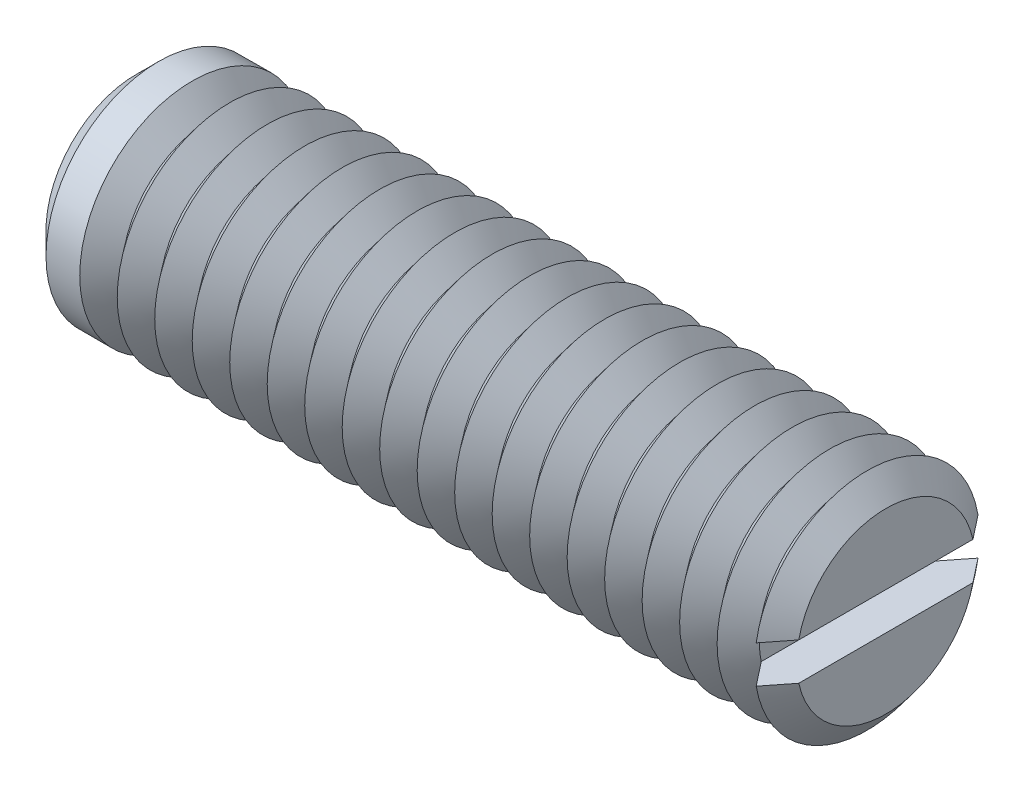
ISO-10303-21;
HEADER;
FILE_DESCRIPTION(('STEP AP214'),'2;1');
FILE_NAME('part.step','',(''),(''),'','','');
FILE_SCHEMA(('AUTOMOTIVE_DESIGN { 1 0 10303 214 1 1 1 1 }'));
ENDSEC;
DATA;
#1=APPLICATION_CONTEXT('core data for automotive mechanical design processes');
#2=APPLICATION_PROTOCOL_DEFINITION('international standard','automotive_design',2000,#1);
#3=PRODUCT_CONTEXT('',#1,'mechanical');
#4=PRODUCT('Part','Part','',(#3));
#5=PRODUCT_RELATED_PRODUCT_CATEGORY('part','',(#4));
#6=PRODUCT_DEFINITION_FORMATION('','',#4);
#7=PRODUCT_DEFINITION_CONTEXT('part definition',#1,'design');
#8=PRODUCT_DEFINITION('design','',#6,#7);
#9=PRODUCT_DEFINITION_SHAPE('','',#8);
#10=(LENGTH_UNIT() NAMED_UNIT(*) SI_UNIT(.MILLI.,.METRE.));
#11=(NAMED_UNIT(*) PLANE_ANGLE_UNIT() SI_UNIT($,.RADIAN.));
#12=(NAMED_UNIT(*) SI_UNIT($,.STERADIAN.) SOLID_ANGLE_UNIT());
#13=UNCERTAINTY_MEASURE_WITH_UNIT(LENGTH_MEASURE(1.E-05),#10,'distance_accuracy_value','');
#14=(GEOMETRIC_REPRESENTATION_CONTEXT(3) GLOBAL_UNCERTAINTY_ASSIGNED_CONTEXT((#13)) GLOBAL_UNIT_ASSIGNED_CONTEXT((#10,
#11,#12)) REPRESENTATION_CONTEXT('',''));
#15=CARTESIAN_POINT('',(0.,0.,0.));
#16=DIRECTION('',(0.,0.,1.));
#17=DIRECTION('',(1.,0.,0.));
#18=AXIS2_PLACEMENT_3D('',#15,#16,#17);
#19=CARTESIAN_POINT('',(9.5,0.,0.));
#20=DIRECTION('',(1.,0.,0.));
#21=DIRECTION('',(0.,0.,-1.));
#22=AXIS2_PLACEMENT_3D('',#19,#20,#21);
#23=CONICAL_SURFACE('',#22,3.,0.895664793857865);
#24=CARTESIAN_POINT('',(9.5,0.,0.));
#25=DIRECTION('',(-1.,0.,0.));
#26=DIRECTION('',(0.,0.,1.));
#27=AXIS2_PLACEMENT_3D('',#24,#25,#26);
#28=CIRCLE('',#27,3.);
#29=CARTESIAN_POINT('',(9.5,-0.5,-2.95803989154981));
#30=VERTEX_POINT('',#29);
#31=CARTESIAN_POINT('',(9.5,-0.5,2.95803989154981));
#32=VERTEX_POINT('',#31);
#33=EDGE_CURVE('E117',#30,#32,#28,.T.);
#34=ORIENTED_EDGE('',*,*,#33,.T.);
#35=CARTESIAN_POINT('',(12.3340158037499,-0.5,-6.52054251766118));
#36=CARTESIAN_POINT('',(12.1513674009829,-0.5,-6.29173953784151));
#37=CARTESIAN_POINT('',(11.9687482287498,-0.5,-6.06291320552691));
#38=CARTESIAN_POINT('',(11.6035782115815,-0.5,-5.60514706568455));
#39=CARTESIAN_POINT('',(11.4210273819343,-0.5,-5.376207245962));
#40=CARTESIAN_POINT('',(11.0555297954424,-0.5,-4.9175522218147));
#41=CARTESIAN_POINT('',(10.8725834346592,-0.5,-4.68783670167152));
#42=CARTESIAN_POINT('',(10.5069310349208,-0.5,-4.22827290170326));
#43=CARTESIAN_POINT('',(10.3242249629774,-0.5,-3.99842464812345));
#44=CARTESIAN_POINT('',(9.94318335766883,-0.5,-3.51834247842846));
#45=CARTESIAN_POINT('',(9.74487865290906,-0.5,-3.26808406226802));
#46=CARTESIAN_POINT('',(9.44795972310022,-0.5,-2.89216906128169));
#47=CARTESIAN_POINT('',(9.34905167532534,-0.5,-2.76674461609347));
#48=CARTESIAN_POINT('',(9.15153741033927,-0.5,-2.5156708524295));
#49=CARTESIAN_POINT('',(9.0529311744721,-0.5,-2.3900215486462));
#50=CARTESIAN_POINT('',(8.85638681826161,-0.5,-2.13862277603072));
#51=CARTESIAN_POINT('',(8.75844773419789,-0.5,-2.01287406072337));
#52=CARTESIAN_POINT('',(8.56331111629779,-0.5,-1.76075275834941));
#53=CARTESIAN_POINT('',(8.46611376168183,-0.5,-1.63438003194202));
#54=CARTESIAN_POINT('',(8.32147344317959,-0.5,-1.4440341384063));
#55=CARTESIAN_POINT('',(8.27347451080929,-0.5,-1.38048388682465));
#56=CARTESIAN_POINT('',(8.17802840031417,-0.5,-1.25297092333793));
#57=CARTESIAN_POINT('',(8.13058121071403,-0.5,-1.18900822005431));
#58=CARTESIAN_POINT('',(8.03655304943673,-0.5,-1.0604855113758));
#59=CARTESIAN_POINT('',(7.98997176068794,-0.5,-0.99592573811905));
#60=CARTESIAN_POINT('',(7.89819618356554,-0.5,-0.86582992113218));
#61=CARTESIAN_POINT('',(7.85300165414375,-0.5,-0.800294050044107));
#62=CARTESIAN_POINT('',(7.79956787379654,-0.5,-0.719528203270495));
#63=CARTESIAN_POINT('',(7.79011148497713,-0.5,-0.705104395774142));
#64=CARTESIAN_POINT('',(7.77134202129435,-0.5,-0.676163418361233));
#65=CARTESIAN_POINT('',(7.76202894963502,-0.5,-0.66164624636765));
#66=CARTESIAN_POINT('',(7.73433559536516,-0.5,-0.617935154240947));
#67=CARTESIAN_POINT('',(7.71620248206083,-0.5,-0.588583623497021));
#68=CARTESIAN_POINT('',(7.68081347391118,-0.5,-0.529281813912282));
#69=CARTESIAN_POINT('',(7.66355916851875,-0.5,-0.499330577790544));
#70=CARTESIAN_POINT('',(7.63035848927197,-0.5,-0.438714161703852));
#71=CARTESIAN_POINT('',(7.61441190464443,-0.5,-0.408049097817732));
#72=CARTESIAN_POINT('',(7.57858417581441,-0.5,-0.333745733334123));
#73=CARTESIAN_POINT('',(7.55956642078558,-0.5,-0.289676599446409));
#74=CARTESIAN_POINT('',(7.5278600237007,-0.5,-0.199412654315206));
#75=CARTESIAN_POINT('',(7.51513658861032,-0.5,-0.153231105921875));
#76=CARTESIAN_POINT('',(7.50111199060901,-0.5,-0.0687562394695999));
#77=CARTESIAN_POINT('',(7.49800550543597,-0.5,-0.0307838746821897));
#78=CARTESIAN_POINT('',(7.49887220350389,-0.5,0.0450573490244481));
#79=CARTESIAN_POINT('',(7.50284115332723,-0.5,0.082926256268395));
#80=CARTESIAN_POINT('',(7.51475152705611,-0.5,0.146691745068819));
#81=CARTESIAN_POINT('',(7.52121667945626,-0.5,0.172890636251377));
#82=CARTESIAN_POINT('',(7.53651087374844,-0.5,0.224599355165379));
#83=CARTESIAN_POINT('',(7.54534169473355,-0.5,0.250108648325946));
#84=CARTESIAN_POINT('',(7.56484803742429,-0.5,0.300632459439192));
#85=CARTESIAN_POINT('',(7.57553782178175,-0.5,0.325641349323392));
#86=CARTESIAN_POINT('',(7.598235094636,-0.5,0.375035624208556));
#87=CARTESIAN_POINT('',(7.61024213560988,-0.5,0.399421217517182));
#88=CARTESIAN_POINT('',(7.65094354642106,-0.5,0.478106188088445));
#89=CARTESIAN_POINT('',(7.68160097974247,-0.5,0.531380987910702));
#90=CARTESIAN_POINT('',(7.74547908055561,-0.5,0.636383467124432));
#91=CARTESIAN_POINT('',(7.77870215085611,-0.5,0.688109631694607));
#92=CARTESIAN_POINT('',(7.84673422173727,-0.5,0.790686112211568));
#93=CARTESIAN_POINT('',(7.88154686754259,-0.5,0.84153400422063));
#94=CARTESIAN_POINT('',(7.95209820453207,-0.5,0.942545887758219));
#95=CARTESIAN_POINT('',(7.98783650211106,-0.5,0.99271015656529));
#96=CARTESIAN_POINT('',(8.06001315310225,-0.5,1.09268759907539));
#97=CARTESIAN_POINT('',(8.09645278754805,-0.5,1.1424998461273));
#98=CARTESIAN_POINT('',(8.16977451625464,-0.5,1.2418047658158));
#99=CARTESIAN_POINT('',(8.20665665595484,-0.5,1.29129740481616));
#100=CARTESIAN_POINT('',(8.31765411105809,-0.5,1.43926830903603));
#101=CARTESIAN_POINT('',(8.39223528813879,-0.5,1.53739673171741));
#102=CARTESIAN_POINT('',(8.547080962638,-0.5,1.73962858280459));
#103=CARTESIAN_POINT('',(8.62739342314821,-0.5,1.8436951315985));
#104=CARTESIAN_POINT('',(8.78850761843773,-0.5,2.05144913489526));
#105=CARTESIAN_POINT('',(8.86930935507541,-0.5,2.15513658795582));
#106=CARTESIAN_POINT('',(9.11218437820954,-0.5,2.46584176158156));
#107=CARTESIAN_POINT('',(9.27472244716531,-0.5,2.67249578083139));
#108=CARTESIAN_POINT('',(9.60051809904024,-0.5,3.08548885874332));
#109=CARTESIAN_POINT('',(9.76377613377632,-0.5,3.29182756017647));
#110=CARTESIAN_POINT('',(10.0906371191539,-0.5,3.70422676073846));
#111=CARTESIAN_POINT('',(10.2542400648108,-0.5,3.9102872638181));
#112=CARTESIAN_POINT('',(10.5774242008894,-0.5,4.31690950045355));
#113=CARTESIAN_POINT('',(10.7369999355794,-0.5,4.51747557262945));
#114=CARTESIAN_POINT('',(11.0562886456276,-0.5,4.91850000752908));
#115=CARTESIAN_POINT('',(11.2160016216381,-0.5,5.11895836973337));
#116=CARTESIAN_POINT('',(11.5353926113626,-0.5,5.51963619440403));
#117=CARTESIAN_POINT('',(11.6950705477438,-0.5,5.71985571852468));
#118=CARTESIAN_POINT('',(12.0144964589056,-0.5,6.12023723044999));
#119=CARTESIAN_POINT('',(12.1742444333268,-0.5,6.32039921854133));
#120=CARTESIAN_POINT('',(12.3340158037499,-0.5,6.52054251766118));
#121=B_SPLINE_CURVE_WITH_KNOTS('',3,(#35,#36,#37,#38,#39,#40,#41,#42,#43,#44,#45,#46,#47,#48,
#49,#50,#51,#52,#53,#54,#55,#56,#57,#58,#59,#60,#61,#62,#63,#64,#65,#66,#67,#68,#69,#70,#71,#72,
#73,#74,#75,#76,#77,#78,#79,#80,#81,#82,#83,#84,#85,#86,#87,#88,#89,#90,#91,#92,#93,#94,#95,#96,
#97,#98,#99,#100,#101,#102,#103,#104,#105,#106,#107,#108,#109,#110,#111,#112,#113,#114,#115,
#116,#117,#118,#119,#120),.UNSPECIFIED.,.F.,.F.,(4,2,2,2,2,2,2,2,2,2,2,2,2,2,2,2,2,2,2,2,2,2,2,
2,2,2,2,2,2,2,2,2,2,2,2,2,2,2,2,2,2,2,4),(0.,0.87829449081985,1.75672728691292,2.63771941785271,
3.51857435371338,4.47648054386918,4.95567426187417,5.43483773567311,5.91300334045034,
6.39128103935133,6.63019943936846,6.86911286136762,7.10793700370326,7.34671939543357,
7.39846053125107,7.45020282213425,7.55369448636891,7.65736712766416,7.76102302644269,
7.90476612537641,8.04770552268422,8.16137782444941,8.27498213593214,8.35581399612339,
8.43670681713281,8.51825011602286,8.59976579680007,8.78399479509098,8.96839847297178,
9.15324864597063,9.33802146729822,9.52317177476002,9.70834126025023,10.0780963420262,
10.472454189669,10.8668135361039,11.65555692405,12.4448978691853,13.2342274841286,
14.0031360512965,14.7720482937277,15.5403347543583,16.3086173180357),.UNSPECIFIED.);
#122=CARTESIAN_POINT('',(9.,-0.5,2.32228361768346));
#123=VERTEX_POINT('',#122);
#124=EDGE_CURVE('E109',#123,#32,#121,.T.);
#125=ORIENTED_EDGE('',*,*,#124,.F.);
#126=CARTESIAN_POINT('',(9.,0.,0.));
#127=DIRECTION('',(-1.,0.,0.));
#128=DIRECTION('',(0.,0.,1.));
#129=AXIS2_PLACEMENT_3D('',#126,#127,#128);
#130=CIRCLE('',#129,2.37550020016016);
#131=CARTESIAN_POINT('',(9.,-0.5,-2.32228361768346));
#132=VERTEX_POINT('',#131);
#133=EDGE_CURVE('E368',#132,#123,#130,.T.);
#134=ORIENTED_EDGE('',*,*,#133,.F.);
#135=EDGE_CURVE('E58',#30,#132,#121,.T.);
#136=ORIENTED_EDGE('',*,*,#135,.F.);
#137=EDGE_LOOP('',(#34,#125,#134,#136));
#138=FACE_BOUND('',#137,.T.);
#139=ADVANCED_FACE('F37',(#138),#23,.T.);
#140=CARTESIAN_POINT('',(9.5,0.5,2.95803989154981));
#141=VERTEX_POINT('',#140);
#142=CARTESIAN_POINT('',(9.5,0.5,-2.95803989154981));
#143=VERTEX_POINT('',#142);
#144=EDGE_CURVE('E100',#141,#143,#28,.T.);
#145=ORIENTED_EDGE('',*,*,#144,.T.);
#146=CARTESIAN_POINT('',(12.3340158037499,0.5,6.52054251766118));
#147=CARTESIAN_POINT('',(12.1513674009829,0.5,6.29173953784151));
#148=CARTESIAN_POINT('',(11.9687482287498,0.5,6.06291320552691));
#149=CARTESIAN_POINT('',(11.6035782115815,0.5,5.60514706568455));
#150=CARTESIAN_POINT('',(11.4210273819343,0.5,5.376207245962));
#151=CARTESIAN_POINT('',(11.0555297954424,0.5,4.9175522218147));
#152=CARTESIAN_POINT('',(10.8725834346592,0.5,4.68783670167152));
#153=CARTESIAN_POINT('',(10.5069310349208,0.5,4.22827290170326));
#154=CARTESIAN_POINT('',(10.3242249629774,0.5,3.99842464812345));
#155=CARTESIAN_POINT('',(9.94318335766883,0.5,3.51834247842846));
#156=CARTESIAN_POINT('',(9.74487865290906,0.5,3.26808406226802));
#157=CARTESIAN_POINT('',(9.44795972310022,0.5,2.89216906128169));
#158=CARTESIAN_POINT('',(9.34905167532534,0.5,2.76674461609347));
#159=CARTESIAN_POINT('',(9.15153741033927,0.5,2.5156708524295));
#160=CARTESIAN_POINT('',(9.0529311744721,0.5,2.3900215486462));
#161=CARTESIAN_POINT('',(8.85638681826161,0.5,2.13862277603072));
#162=CARTESIAN_POINT('',(8.75844773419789,0.5,2.01287406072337));
#163=CARTESIAN_POINT('',(8.56331111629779,0.5,1.76075275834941));
#164=CARTESIAN_POINT('',(8.46611376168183,0.5,1.63438003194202));
#165=CARTESIAN_POINT('',(8.32147344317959,0.5,1.4440341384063));
#166=CARTESIAN_POINT('',(8.27347451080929,0.5,1.38048388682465));
#167=CARTESIAN_POINT('',(8.17802840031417,0.5,1.25297092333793));
#168=CARTESIAN_POINT('',(8.13058121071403,0.5,1.18900822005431));
#169=CARTESIAN_POINT('',(8.03655304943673,0.5,1.0604855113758));
#170=CARTESIAN_POINT('',(7.98997176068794,0.5,0.99592573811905));
#171=CARTESIAN_POINT('',(7.89819618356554,0.5,0.86582992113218));
#172=CARTESIAN_POINT('',(7.85300165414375,0.5,0.800294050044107));
#173=CARTESIAN_POINT('',(7.79956787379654,0.5,0.719528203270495));
#174=CARTESIAN_POINT('',(7.79011148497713,0.5,0.705104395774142));
#175=CARTESIAN_POINT('',(7.77134202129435,0.5,0.676163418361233));
#176=CARTESIAN_POINT('',(7.76202894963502,0.5,0.66164624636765));
#177=CARTESIAN_POINT('',(7.73433559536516,0.5,0.617935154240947));
#178=CARTESIAN_POINT('',(7.71620248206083,0.5,0.588583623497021));
#179=CARTESIAN_POINT('',(7.68081347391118,0.5,0.529281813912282));
#180=CARTESIAN_POINT('',(7.66355916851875,0.5,0.499330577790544));
#181=CARTESIAN_POINT('',(7.63035848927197,0.5,0.438714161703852));
#182=CARTESIAN_POINT('',(7.61441190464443,0.5,0.408049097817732));
#183=CARTESIAN_POINT('',(7.57858417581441,0.5,0.333745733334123));
#184=CARTESIAN_POINT('',(7.55956642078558,0.5,0.289676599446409));
#185=CARTESIAN_POINT('',(7.5278600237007,0.5,0.199412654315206));
#186=CARTESIAN_POINT('',(7.51513658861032,0.5,0.153231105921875));
#187=CARTESIAN_POINT('',(7.50111199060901,0.5,0.0687562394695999));
#188=CARTESIAN_POINT('',(7.49800550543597,0.5,0.0307838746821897));
#189=CARTESIAN_POINT('',(7.49887220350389,0.5,-0.0450573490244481));
#190=CARTESIAN_POINT('',(7.50284115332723,0.5,-0.082926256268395));
#191=CARTESIAN_POINT('',(7.51475152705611,0.5,-0.146691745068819));
#192=CARTESIAN_POINT('',(7.52121667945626,0.5,-0.172890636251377));
#193=CARTESIAN_POINT('',(7.53651087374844,0.5,-0.224599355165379));
#194=CARTESIAN_POINT('',(7.54534169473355,0.5,-0.250108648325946));
#195=CARTESIAN_POINT('',(7.56484803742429,0.5,-0.300632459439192));
#196=CARTESIAN_POINT('',(7.57553782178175,0.5,-0.325641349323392));
#197=CARTESIAN_POINT('',(7.598235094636,0.5,-0.375035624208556));
#198=CARTESIAN_POINT('',(7.61024213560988,0.5,-0.399421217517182));
#199=CARTESIAN_POINT('',(7.65094354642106,0.5,-0.478106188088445));
#200=CARTESIAN_POINT('',(7.68160097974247,0.5,-0.531380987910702));
#201=CARTESIAN_POINT('',(7.74547908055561,0.5,-0.636383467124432));
#202=CARTESIAN_POINT('',(7.77870215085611,0.5,-0.688109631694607));
#203=CARTESIAN_POINT('',(7.84673422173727,0.5,-0.790686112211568));
#204=CARTESIAN_POINT('',(7.88154686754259,0.5,-0.84153400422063));
#205=CARTESIAN_POINT('',(7.95209820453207,0.5,-0.942545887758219));
#206=CARTESIAN_POINT('',(7.98783650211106,0.5,-0.99271015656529));
#207=CARTESIAN_POINT('',(8.06001315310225,0.5,-1.09268759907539));
#208=CARTESIAN_POINT('',(8.09645278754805,0.5,-1.1424998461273));
#209=CARTESIAN_POINT('',(8.16977451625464,0.5,-1.2418047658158));
#210=CARTESIAN_POINT('',(8.20665665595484,0.5,-1.29129740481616));
#211=CARTESIAN_POINT('',(8.31765411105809,0.5,-1.43926830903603));
#212=CARTESIAN_POINT('',(8.39223528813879,0.5,-1.53739673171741));
#213=CARTESIAN_POINT('',(8.547080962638,0.5,-1.73962858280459));
#214=CARTESIAN_POINT('',(8.62739342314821,0.5,-1.8436951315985));
#215=CARTESIAN_POINT('',(8.78850761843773,0.5,-2.05144913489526));
#216=CARTESIAN_POINT('',(8.86930935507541,0.5,-2.15513658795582));
#217=CARTESIAN_POINT('',(9.11218437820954,0.5,-2.46584176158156));
#218=CARTESIAN_POINT('',(9.27472244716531,0.5,-2.67249578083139));
#219=CARTESIAN_POINT('',(9.60051809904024,0.5,-3.08548885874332));
#220=CARTESIAN_POINT('',(9.76377613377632,0.5,-3.29182756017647));
#221=CARTESIAN_POINT('',(10.0906371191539,0.5,-3.70422676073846));
#222=CARTESIAN_POINT('',(10.2542400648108,0.5,-3.9102872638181));
#223=CARTESIAN_POINT('',(10.5774242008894,0.5,-4.31690950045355));
#224=CARTESIAN_POINT('',(10.7369999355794,0.5,-4.51747557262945));
#225=CARTESIAN_POINT('',(11.0562886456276,0.5,-4.91850000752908));
#226=CARTESIAN_POINT('',(11.2160016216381,0.5,-5.11895836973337));
#227=CARTESIAN_POINT('',(11.5353926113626,0.5,-5.51963619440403));
#228=CARTESIAN_POINT('',(11.6950705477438,0.5,-5.71985571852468));
#229=CARTESIAN_POINT('',(12.0144964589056,0.5,-6.12023723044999));
#230=CARTESIAN_POINT('',(12.1742444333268,0.5,-6.32039921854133));
#231=CARTESIAN_POINT('',(12.3340158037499,0.5,-6.52054251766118));
#232=B_SPLINE_CURVE_WITH_KNOTS('',3,(#146,#147,#148,#149,#150,#151,#152,#153,#154,#155,#156,
#157,#158,#159,#160,#161,#162,#163,#164,#165,#166,#167,#168,#169,#170,#171,#172,#173,#174,#175,
#176,#177,#178,#179,#180,#181,#182,#183,#184,#185,#186,#187,#188,#189,#190,#191,#192,#193,#194,
#195,#196,#197,#198,#199,#200,#201,#202,#203,#204,#205,#206,#207,#208,#209,#210,#211,#212,#213,
#214,#215,#216,#217,#218,#219,#220,#221,#222,#223,#224,#225,#226,#227,#228,#229,#230,#231),
.UNSPECIFIED.,.F.,.F.,(4,2,2,2,2,2,2,2,2,2,2,2,2,2,2,2,2,2,2,2,2,2,2,2,2,2,2,2,2,2,2,2,2,2,2,2,
2,2,2,2,2,2,4),(0.,0.87829449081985,1.75672728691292,2.63771941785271,3.51857435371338,
4.47648054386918,4.95567426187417,5.43483773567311,5.91300334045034,6.39128103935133,
6.63019943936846,6.86911286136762,7.10793700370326,7.34671939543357,7.39846053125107,
7.45020282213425,7.55369448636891,7.65736712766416,7.76102302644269,7.90476612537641,
8.04770552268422,8.16137782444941,8.27498213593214,8.35581399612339,8.43670681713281,
8.51825011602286,8.59976579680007,8.78399479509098,8.96839847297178,9.15324864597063,
9.33802146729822,9.52317177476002,9.70834126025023,10.0780963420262,10.472454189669,
10.8668135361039,11.65555692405,12.4448978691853,13.2342274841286,14.0031360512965,
14.7720482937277,15.5403347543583,16.3086173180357),.UNSPECIFIED.);
#233=CARTESIAN_POINT('',(9.,0.5,-2.32228361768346));
#234=VERTEX_POINT('',#233);
#235=EDGE_CURVE('E110',#234,#143,#232,.T.);
#236=ORIENTED_EDGE('',*,*,#235,.F.);
#237=CARTESIAN_POINT('',(9.,0.5,2.32228361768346));
#238=VERTEX_POINT('',#237);
#239=EDGE_CURVE('E103',#238,#234,#130,.T.);
#240=ORIENTED_EDGE('',*,*,#239,.F.);
#241=EDGE_CURVE('E97',#141,#238,#232,.T.);
#242=ORIENTED_EDGE('',*,*,#241,.F.);
#243=EDGE_LOOP('',(#145,#236,#240,#242));
#244=FACE_BOUND('',#243,.T.);
#245=ADVANCED_FACE('F99',(#244),#23,.T.);
#246=CARTESIAN_POINT('',(9.,0.,0.));
#247=DIRECTION('',(-1.,0.,0.));
#248=DIRECTION('',(0.,0.,1.));
#249=AXIS2_PLACEMENT_3D('',#246,#247,#248);
#250=CONICAL_SURFACE('',#249,2.37550020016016,0.895664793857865);
#251=CARTESIAN_POINT('',(8.5,0.,0.));
#252=DIRECTION('',(-1.,0.,0.));
#253=DIRECTION('',(0.,0.,1.));
#254=AXIS2_PLACEMENT_3D('',#251,#252,#253);
#255=CIRCLE('',#254,3.);
#256=CARTESIAN_POINT('',(8.5,0.,3.));
#257=VERTEX_POINT('',#256);
#258=EDGE_CURVE('E355',#257,#257,#255,.T.);
#259=ORIENTED_EDGE('',*,*,#258,.F.);
#260=EDGE_LOOP('',(#259));
#261=FACE_BOUND('',#260,.T.);
#262=ORIENTED_EDGE('',*,*,#239,.T.);
#263=EDGE_CURVE('E362',#234,#132,#130,.T.);
#264=ORIENTED_EDGE('',*,*,#263,.T.);
#265=ORIENTED_EDGE('',*,*,#133,.T.);
#266=EDGE_CURVE('E361',#123,#238,#130,.T.);
#267=ORIENTED_EDGE('',*,*,#266,.T.);
#268=EDGE_LOOP('',(#262,#264,#265,#267));
#269=FACE_BOUND('',#268,.T.);
#270=ADVANCED_FACE('F168',(#261,#269),#250,.T.);
#271=CARTESIAN_POINT('',(10.,0.,0.));
#272=DIRECTION('',(1.,0.,0.));
#273=DIRECTION('',(0.,0.,-1.));
#274=AXIS2_PLACEMENT_3D('',#271,#272,#273);
#275=PLANE('',#274);
#276=CARTESIAN_POINT('',(10.,0.,0.));
#277=DIRECTION('',(-1.,0.,0.));
#278=DIRECTION('',(0.,0.,1.));
#279=AXIS2_PLACEMENT_3D('',#276,#277,#278);
#280=CIRCLE('',#279,2.37550020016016);
#281=CARTESIAN_POINT('',(10.,0.5,2.32228361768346));
#282=VERTEX_POINT('',#281);
#283=CARTESIAN_POINT('',(10.,0.5,-2.32228361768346));
#284=VERTEX_POINT('',#283);
#285=EDGE_CURVE('E160',#282,#284,#280,.T.);
#286=ORIENTED_EDGE('',*,*,#285,.F.);
#287=DIRECTION('',(0.,0.,1.));
#288=VECTOR('',#287,1.);
#289=CARTESIAN_POINT('',(10.,0.5,0.));
#290=LINE('',#289,#288);
#291=EDGE_CURVE('E122',#284,#282,#290,.T.);
#292=ORIENTED_EDGE('',*,*,#291,.F.);
#293=EDGE_LOOP('',(#286,#292));
#294=FACE_BOUND('',#293,.T.);
#295=ADVANCED_FACE('F172',(#294),#275,.T.);
#296=CARTESIAN_POINT('',(10.,-0.5,-2.32228361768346));
#297=VERTEX_POINT('',#296);
#298=CARTESIAN_POINT('',(10.,-0.5,2.32228361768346));
#299=VERTEX_POINT('',#298);
#300=EDGE_CURVE('E66',#297,#299,#280,.T.);
#301=ORIENTED_EDGE('',*,*,#300,.F.);
#302=DIRECTION('',(0.,0.,-1.));
#303=VECTOR('',#302,1.);
#304=CARTESIAN_POINT('',(10.,-0.5,0.));
#305=LINE('',#304,#303);
#306=EDGE_CURVE('E136',#299,#297,#305,.T.);
#307=ORIENTED_EDGE('',*,*,#306,.F.);
#308=EDGE_LOOP('',(#301,#307));
#309=FACE_BOUND('',#308,.T.);
#310=ADVANCED_FACE('F201',(#309),#275,.T.);
#311=CARTESIAN_POINT('',(10.,0.,0.));
#312=DIRECTION('',(-1.,0.,0.));
#313=DIRECTION('',(0.,0.,1.));
#314=AXIS2_PLACEMENT_3D('',#311,#312,#313);
#315=CONICAL_SURFACE('',#314,2.37550020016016,0.895664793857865);
#316=ORIENTED_EDGE('',*,*,#144,.F.);
#317=CARTESIAN_POINT('',(6.66598419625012,0.5,-6.52054251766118));
#318=CARTESIAN_POINT('',(6.84863259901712,0.5,-6.29173953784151));
#319=CARTESIAN_POINT('',(7.03125177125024,0.5,-6.06291320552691));
#320=CARTESIAN_POINT('',(7.39642178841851,0.5,-5.60514706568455));
#321=CARTESIAN_POINT('',(7.57897261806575,0.5,-5.376207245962));
#322=CARTESIAN_POINT('',(7.94447020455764,0.5,-4.91755222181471));
#323=CARTESIAN_POINT('',(8.12741656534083,0.5,-4.68783670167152));
#324=CARTESIAN_POINT('',(8.49306896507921,0.5,-4.22827290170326));
#325=CARTESIAN_POINT('',(8.67577503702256,0.5,-3.99842464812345));
#326=CARTESIAN_POINT('',(9.05681664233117,0.5,-3.51834247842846));
#327=CARTESIAN_POINT('',(9.25512134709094,0.5,-3.26808406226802));
#328=CARTESIAN_POINT('',(9.55204027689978,0.5,-2.89216906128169));
#329=CARTESIAN_POINT('',(9.65094832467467,0.5,-2.76674461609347));
#330=CARTESIAN_POINT('',(9.84846258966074,0.5,-2.5156708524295));
#331=CARTESIAN_POINT('',(9.9470688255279,0.5,-2.3900215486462));
#332=CARTESIAN_POINT('',(10.1436131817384,0.5,-2.13862277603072));
#333=CARTESIAN_POINT('',(10.2415522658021,0.5,-2.01287406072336));
#334=CARTESIAN_POINT('',(10.4366888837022,0.5,-1.76075275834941));
#335=CARTESIAN_POINT('',(10.5338862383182,0.5,-1.63438003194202));
#336=CARTESIAN_POINT('',(10.6785265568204,0.5,-1.4440341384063));
#337=CARTESIAN_POINT('',(10.7265254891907,0.5,-1.38048388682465));
#338=CARTESIAN_POINT('',(10.8219715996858,0.5,-1.25297092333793));
#339=CARTESIAN_POINT('',(10.869418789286,0.5,-1.18900822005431));
#340=CARTESIAN_POINT('',(10.9634469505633,0.5,-1.0604855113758));
#341=CARTESIAN_POINT('',(11.0100282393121,0.5,-0.995925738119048));
#342=CARTESIAN_POINT('',(11.1018038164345,0.5,-0.86582992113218));
#343=CARTESIAN_POINT('',(11.1469983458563,0.5,-0.800294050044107));
#344=CARTESIAN_POINT('',(11.2004321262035,0.5,-0.719528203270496));
#345=CARTESIAN_POINT('',(11.2098885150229,0.5,-0.705104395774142));
#346=CARTESIAN_POINT('',(11.2286579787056,0.5,-0.676163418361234));
#347=CARTESIAN_POINT('',(11.237971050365,0.5,-0.661646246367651));
#348=CARTESIAN_POINT('',(11.2656644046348,0.5,-0.617935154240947));
#349=CARTESIAN_POINT('',(11.2837975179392,0.5,-0.588583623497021));
#350=CARTESIAN_POINT('',(11.3191865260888,0.5,-0.529281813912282));
#351=CARTESIAN_POINT('',(11.3364408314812,0.5,-0.499330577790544));
#352=CARTESIAN_POINT('',(11.369641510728,0.5,-0.438714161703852));
#353=CARTESIAN_POINT('',(11.3855880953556,0.5,-0.408049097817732));
#354=CARTESIAN_POINT('',(11.4214158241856,0.5,-0.333745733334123));
#355=CARTESIAN_POINT('',(11.4404335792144,0.5,-0.289676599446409));
#356=CARTESIAN_POINT('',(11.4721399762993,0.5,-0.199412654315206));
#357=CARTESIAN_POINT('',(11.4848634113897,0.5,-0.153231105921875));
#358=CARTESIAN_POINT('',(11.498888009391,0.5,-0.0687562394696));
#359=CARTESIAN_POINT('',(11.501994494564,0.5,-0.0307838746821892));
#360=CARTESIAN_POINT('',(11.5011277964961,0.5,0.0450573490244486));
#361=CARTESIAN_POINT('',(11.4971588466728,0.5,0.0829262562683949));
#362=CARTESIAN_POINT('',(11.4852484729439,0.5,0.146691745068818));
#363=CARTESIAN_POINT('',(11.4787833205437,0.5,0.172890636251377));
#364=CARTESIAN_POINT('',(11.4634891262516,0.5,0.224599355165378));
#365=CARTESIAN_POINT('',(11.4546583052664,0.5,0.250108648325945));
#366=CARTESIAN_POINT('',(11.4351519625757,0.5,0.30063245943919));
#367=CARTESIAN_POINT('',(11.4244621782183,0.5,0.32564134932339));
#368=CARTESIAN_POINT('',(11.401764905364,0.5,0.375035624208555));
#369=CARTESIAN_POINT('',(11.3897578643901,0.5,0.39942121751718));
#370=CARTESIAN_POINT('',(11.3490564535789,0.5,0.478106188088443));
#371=CARTESIAN_POINT('',(11.3183990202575,0.5,0.531380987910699));
#372=CARTESIAN_POINT('',(11.2545209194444,0.5,0.636383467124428));
#373=CARTESIAN_POINT('',(11.2212978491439,0.5,0.688109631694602));
#374=CARTESIAN_POINT('',(11.1532657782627,0.5,0.790686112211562));
#375=CARTESIAN_POINT('',(11.1184531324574,0.5,0.841534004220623));
#376=CARTESIAN_POINT('',(11.0479017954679,0.5,0.942545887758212));
#377=CARTESIAN_POINT('',(11.0121634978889,0.5,0.992710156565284));
#378=CARTESIAN_POINT('',(10.9399868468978,0.5,1.09268759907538));
#379=CARTESIAN_POINT('',(10.903547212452,0.5,1.14249984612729));
#380=CARTESIAN_POINT('',(10.8302254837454,0.5,1.24180476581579));
#381=CARTESIAN_POINT('',(10.7933433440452,0.5,1.29129740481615));
#382=CARTESIAN_POINT('',(10.6823458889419,0.5,1.43926830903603));
#383=CARTESIAN_POINT('',(10.6077647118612,0.5,1.5373967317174));
#384=CARTESIAN_POINT('',(10.452919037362,0.5,1.73962858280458));
#385=CARTESIAN_POINT('',(10.3726065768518,0.5,1.8436951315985));
#386=CARTESIAN_POINT('',(10.2114923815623,0.5,2.05144913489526));
#387=CARTESIAN_POINT('',(10.1306906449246,0.5,2.15513658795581));
#388=CARTESIAN_POINT('',(9.88781562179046,0.5,2.46584176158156));
#389=CARTESIAN_POINT('',(9.7252775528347,0.5,2.67249578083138));
#390=CARTESIAN_POINT('',(9.39948190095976,0.5,3.08548885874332));
#391=CARTESIAN_POINT('',(9.23622386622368,0.5,3.29182756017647));
#392=CARTESIAN_POINT('',(8.90936288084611,0.5,3.70422676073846));
#393=CARTESIAN_POINT('',(8.74575993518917,0.5,3.91028726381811));
#394=CARTESIAN_POINT('',(8.42257579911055,0.5,4.31690950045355));
#395=CARTESIAN_POINT('',(8.26300006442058,0.5,4.51747557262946));
#396=CARTESIAN_POINT('',(7.94371135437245,0.5,4.91850000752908));
#397=CARTESIAN_POINT('',(7.78399837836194,0.5,5.11895836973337));
#398=CARTESIAN_POINT('',(7.46460738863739,0.5,5.51963619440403));
#399=CARTESIAN_POINT('',(7.30492945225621,0.5,5.71985571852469));
#400=CARTESIAN_POINT('',(6.98550354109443,0.5,6.12023723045));
#401=CARTESIAN_POINT('',(6.82575556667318,0.5,6.32039921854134));
#402=CARTESIAN_POINT('',(6.66598419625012,0.5,6.52054251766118));
#403=B_SPLINE_CURVE_WITH_KNOTS('',3,(#317,#318,#319,#320,#321,#322,#323,#324,#325,#326,#327,
#328,#329,#330,#331,#332,#333,#334,#335,#336,#337,#338,#339,#340,#341,#342,#343,#344,#345,#346,
#347,#348,#349,#350,#351,#352,#353,#354,#355,#356,#357,#358,#359,#360,#361,#362,#363,#364,#365,
#366,#367,#368,#369,#370,#371,#372,#373,#374,#375,#376,#377,#378,#379,#380,#381,#382,#383,#384,
#385,#386,#387,#388,#389,#390,#391,#392,#393,#394,#395,#396,#397,#398,#399,#400,#401,#402),
.UNSPECIFIED.,.F.,.F.,(4,2,2,2,2,2,2,2,2,2,2,2,2,2,2,2,2,2,2,2,2,2,2,2,2,2,2,2,2,2,2,2,2,2,2,2,
2,2,2,2,2,2,4),(0.,0.878294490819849,1.75672728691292,2.63771941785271,3.51857435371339,
4.47648054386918,4.95567426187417,5.43483773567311,5.91300334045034,6.39128103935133,
6.63019943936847,6.86911286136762,7.10793700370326,7.34671939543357,7.39846053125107,
7.45020282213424,7.5536944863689,7.65736712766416,7.76102302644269,7.9047661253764,
8.04770552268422,8.16137782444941,8.27498213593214,8.35581399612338,8.43670681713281,
8.51825011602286,8.59976579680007,8.78399479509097,8.96839847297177,9.15324864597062,
9.3380214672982,9.52317177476,9.70834126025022,10.0780963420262,10.472454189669,
10.8668135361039,11.65555692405,12.4448978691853,13.2342274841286,14.0031360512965,
14.7720482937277,15.5403347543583,16.3086173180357),.UNSPECIFIED.);
#404=EDGE_CURVE('E41',#282,#141,#403,.T.);
#405=ORIENTED_EDGE('',*,*,#404,.F.);
#406=ORIENTED_EDGE('',*,*,#285,.T.);
#407=EDGE_CURVE('E11',#143,#284,#403,.T.);
#408=ORIENTED_EDGE('',*,*,#407,.F.);
#409=EDGE_LOOP('',(#316,#405,#406,#408));
#410=FACE_BOUND('',#409,.T.);
#411=ADVANCED_FACE('F114',(#410),#315,.T.);
#412=CARTESIAN_POINT('',(10.,0.5,-4.5));
#413=DIRECTION('',(0.,1.,0.));
#414=DIRECTION('',(0.,0.,1.));
#415=AXIS2_PLACEMENT_3D('',#412,#413,#414);
#416=PLANE('',#415);
#417=ORIENTED_EDGE('',*,*,#404,.T.);
#418=ORIENTED_EDGE('',*,*,#241,.T.);
#419=DIRECTION('',(0.,0.,1.));
#420=VECTOR('',#419,1.);
#421=CARTESIAN_POINT('',(9.,0.5,-4.5));
#422=LINE('',#421,#420);
#423=EDGE_CURVE('E145',#234,#238,#422,.T.);
#424=ORIENTED_EDGE('',*,*,#423,.F.);
#425=ORIENTED_EDGE('',*,*,#235,.T.);
#426=ORIENTED_EDGE('',*,*,#407,.T.);
#427=ORIENTED_EDGE('',*,*,#291,.T.);
#428=EDGE_LOOP('',(#417,#418,#424,#425,#426,#427));
#429=FACE_BOUND('',#428,.T.);
#430=ADVANCED_FACE('F120',(#429),#416,.F.);
#431=ORIENTED_EDGE('',*,*,#33,.F.);
#432=CARTESIAN_POINT('',(6.66598419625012,-0.5,6.52054251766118));
#433=CARTESIAN_POINT('',(6.84863259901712,-0.5,6.29173953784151));
#434=CARTESIAN_POINT('',(7.03125177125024,-0.5,6.06291320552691));
#435=CARTESIAN_POINT('',(7.39642178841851,-0.5,5.60514706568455));
#436=CARTESIAN_POINT('',(7.57897261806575,-0.5,5.376207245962));
#437=CARTESIAN_POINT('',(7.94447020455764,-0.5,4.91755222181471));
#438=CARTESIAN_POINT('',(8.12741656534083,-0.5,4.68783670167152));
#439=CARTESIAN_POINT('',(8.49306896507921,-0.5,4.22827290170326));
#440=CARTESIAN_POINT('',(8.67577503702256,-0.5,3.99842464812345));
#441=CARTESIAN_POINT('',(9.05681664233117,-0.5,3.51834247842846));
#442=CARTESIAN_POINT('',(9.25512134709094,-0.5,3.26808406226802));
#443=CARTESIAN_POINT('',(9.55204027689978,-0.5,2.89216906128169));
#444=CARTESIAN_POINT('',(9.65094832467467,-0.5,2.76674461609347));
#445=CARTESIAN_POINT('',(9.84846258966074,-0.5,2.5156708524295));
#446=CARTESIAN_POINT('',(9.9470688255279,-0.5,2.3900215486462));
#447=CARTESIAN_POINT('',(10.1436131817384,-0.5,2.13862277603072));
#448=CARTESIAN_POINT('',(10.2415522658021,-0.5,2.01287406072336));
#449=CARTESIAN_POINT('',(10.4366888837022,-0.5,1.76075275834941));
#450=CARTESIAN_POINT('',(10.5338862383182,-0.5,1.63438003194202));
#451=CARTESIAN_POINT('',(10.6785265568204,-0.5,1.4440341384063));
#452=CARTESIAN_POINT('',(10.7265254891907,-0.5,1.38048388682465));
#453=CARTESIAN_POINT('',(10.8219715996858,-0.5,1.25297092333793));
#454=CARTESIAN_POINT('',(10.869418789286,-0.5,1.18900822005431));
#455=CARTESIAN_POINT('',(10.9634469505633,-0.5,1.0604855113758));
#456=CARTESIAN_POINT('',(11.0100282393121,-0.5,0.995925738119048));
#457=CARTESIAN_POINT('',(11.1018038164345,-0.5,0.86582992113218));
#458=CARTESIAN_POINT('',(11.1469983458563,-0.5,0.800294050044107));
#459=CARTESIAN_POINT('',(11.2004321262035,-0.5,0.719528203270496));
#460=CARTESIAN_POINT('',(11.2098885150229,-0.5,0.705104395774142));
#461=CARTESIAN_POINT('',(11.2286579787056,-0.5,0.676163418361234));
#462=CARTESIAN_POINT('',(11.237971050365,-0.5,0.661646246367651));
#463=CARTESIAN_POINT('',(11.2656644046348,-0.5,0.617935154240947));
#464=CARTESIAN_POINT('',(11.2837975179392,-0.5,0.588583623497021));
#465=CARTESIAN_POINT('',(11.3191865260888,-0.5,0.529281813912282));
#466=CARTESIAN_POINT('',(11.3364408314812,-0.5,0.499330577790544));
#467=CARTESIAN_POINT('',(11.369641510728,-0.5,0.438714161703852));
#468=CARTESIAN_POINT('',(11.3855880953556,-0.5,0.408049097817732));
#469=CARTESIAN_POINT('',(11.4214158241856,-0.5,0.333745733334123));
#470=CARTESIAN_POINT('',(11.4404335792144,-0.5,0.289676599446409));
#471=CARTESIAN_POINT('',(11.4721399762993,-0.5,0.199412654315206));
#472=CARTESIAN_POINT('',(11.4848634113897,-0.5,0.153231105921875));
#473=CARTESIAN_POINT('',(11.498888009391,-0.5,0.0687562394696));
#474=CARTESIAN_POINT('',(11.501994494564,-0.5,0.0307838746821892));
#475=CARTESIAN_POINT('',(11.5011277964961,-0.5,-0.0450573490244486));
#476=CARTESIAN_POINT('',(11.4971588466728,-0.5,-0.0829262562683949));
#477=CARTESIAN_POINT('',(11.4852484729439,-0.5,-0.146691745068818));
#478=CARTESIAN_POINT('',(11.4787833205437,-0.5,-0.172890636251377));
#479=CARTESIAN_POINT('',(11.4634891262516,-0.5,-0.224599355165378));
#480=CARTESIAN_POINT('',(11.4546583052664,-0.5,-0.250108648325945));
#481=CARTESIAN_POINT('',(11.4351519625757,-0.5,-0.30063245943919));
#482=CARTESIAN_POINT('',(11.4244621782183,-0.5,-0.32564134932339));
#483=CARTESIAN_POINT('',(11.401764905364,-0.5,-0.375035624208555));
#484=CARTESIAN_POINT('',(11.3897578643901,-0.5,-0.39942121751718));
#485=CARTESIAN_POINT('',(11.3490564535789,-0.5,-0.478106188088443));
#486=CARTESIAN_POINT('',(11.3183990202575,-0.5,-0.531380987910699));
#487=CARTESIAN_POINT('',(11.2545209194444,-0.5,-0.636383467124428));
#488=CARTESIAN_POINT('',(11.2212978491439,-0.5,-0.688109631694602));
#489=CARTESIAN_POINT('',(11.1532657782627,-0.5,-0.790686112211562));
#490=CARTESIAN_POINT('',(11.1184531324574,-0.5,-0.841534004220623));
#491=CARTESIAN_POINT('',(11.0479017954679,-0.5,-0.942545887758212));
#492=CARTESIAN_POINT('',(11.0121634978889,-0.5,-0.992710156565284));
#493=CARTESIAN_POINT('',(10.9399868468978,-0.5,-1.09268759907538));
#494=CARTESIAN_POINT('',(10.903547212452,-0.5,-1.14249984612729));
#495=CARTESIAN_POINT('',(10.8302254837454,-0.5,-1.24180476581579));
#496=CARTESIAN_POINT('',(10.7933433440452,-0.5,-1.29129740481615));
#497=CARTESIAN_POINT('',(10.6823458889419,-0.5,-1.43926830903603));
#498=CARTESIAN_POINT('',(10.6077647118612,-0.5,-1.5373967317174));
#499=CARTESIAN_POINT('',(10.452919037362,-0.5,-1.73962858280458));
#500=CARTESIAN_POINT('',(10.3726065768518,-0.5,-1.8436951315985));
#501=CARTESIAN_POINT('',(10.2114923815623,-0.5,-2.05144913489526));
#502=CARTESIAN_POINT('',(10.1306906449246,-0.5,-2.15513658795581));
#503=CARTESIAN_POINT('',(9.88781562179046,-0.5,-2.46584176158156));
#504=CARTESIAN_POINT('',(9.7252775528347,-0.5,-2.67249578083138));
#505=CARTESIAN_POINT('',(9.39948190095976,-0.5,-3.08548885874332));
#506=CARTESIAN_POINT('',(9.23622386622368,-0.5,-3.29182756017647));
#507=CARTESIAN_POINT('',(8.90936288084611,-0.5,-3.70422676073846));
#508=CARTESIAN_POINT('',(8.74575993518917,-0.5,-3.91028726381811));
#509=CARTESIAN_POINT('',(8.42257579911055,-0.5,-4.31690950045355));
#510=CARTESIAN_POINT('',(8.26300006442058,-0.5,-4.51747557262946));
#511=CARTESIAN_POINT('',(7.94371135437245,-0.5,-4.91850000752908));
#512=CARTESIAN_POINT('',(7.78399837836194,-0.5,-5.11895836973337));
#513=CARTESIAN_POINT('',(7.46460738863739,-0.5,-5.51963619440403));
#514=CARTESIAN_POINT('',(7.30492945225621,-0.5,-5.71985571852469));
#515=CARTESIAN_POINT('',(6.98550354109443,-0.5,-6.12023723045));
#516=CARTESIAN_POINT('',(6.82575556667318,-0.5,-6.32039921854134));
#517=CARTESIAN_POINT('',(6.66598419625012,-0.5,-6.52054251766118));
#518=B_SPLINE_CURVE_WITH_KNOTS('',3,(#432,#433,#434,#435,#436,#437,#438,#439,#440,#441,#442,
#443,#444,#445,#446,#447,#448,#449,#450,#451,#452,#453,#454,#455,#456,#457,#458,#459,#460,#461,
#462,#463,#464,#465,#466,#467,#468,#469,#470,#471,#472,#473,#474,#475,#476,#477,#478,#479,#480,
#481,#482,#483,#484,#485,#486,#487,#488,#489,#490,#491,#492,#493,#494,#495,#496,#497,#498,#499,
#500,#501,#502,#503,#504,#505,#506,#507,#508,#509,#510,#511,#512,#513,#514,#515,#516,#517),
.UNSPECIFIED.,.F.,.F.,(4,2,2,2,2,2,2,2,2,2,2,2,2,2,2,2,2,2,2,2,2,2,2,2,2,2,2,2,2,2,2,2,2,2,2,2,
2,2,2,2,2,2,4),(0.,0.878294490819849,1.75672728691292,2.63771941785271,3.51857435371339,
4.47648054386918,4.95567426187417,5.43483773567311,5.91300334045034,6.39128103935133,
6.63019943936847,6.86911286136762,7.10793700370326,7.34671939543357,7.39846053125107,
7.45020282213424,7.5536944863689,7.65736712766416,7.76102302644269,7.9047661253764,
8.04770552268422,8.16137782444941,8.27498213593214,8.35581399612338,8.43670681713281,
8.51825011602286,8.59976579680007,8.78399479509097,8.96839847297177,9.15324864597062,
9.3380214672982,9.52317177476,9.70834126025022,10.0780963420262,10.472454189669,
10.8668135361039,11.65555692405,12.4448978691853,13.2342274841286,14.0031360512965,
14.7720482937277,15.5403347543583,16.3086173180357),.UNSPECIFIED.);
#519=EDGE_CURVE('E152',#297,#30,#518,.T.);
#520=ORIENTED_EDGE('',*,*,#519,.F.);
#521=ORIENTED_EDGE('',*,*,#300,.T.);
#522=EDGE_CURVE('E148',#32,#299,#518,.T.);
#523=ORIENTED_EDGE('',*,*,#522,.F.);
#524=EDGE_LOOP('',(#431,#520,#521,#523));
#525=FACE_BOUND('',#524,.T.);
#526=ADVANCED_FACE('F164',(#525),#315,.T.);
#527=CARTESIAN_POINT('',(10.,-0.5,-4.5));
#528=DIRECTION('',(0.,-1.,0.));
#529=DIRECTION('',(0.,0.,-1.));
#530=AXIS2_PLACEMENT_3D('',#527,#528,#529);
#531=PLANE('',#530);
#532=ORIENTED_EDGE('',*,*,#519,.T.);
#533=ORIENTED_EDGE('',*,*,#135,.T.);
#534=DIRECTION('',(0.,0.,1.));
#535=VECTOR('',#534,1.);
#536=CARTESIAN_POINT('',(9.,-0.5,-4.5));
#537=LINE('',#536,#535);
#538=EDGE_CURVE('E144',#132,#123,#537,.T.);
#539=ORIENTED_EDGE('',*,*,#538,.T.);
#540=ORIENTED_EDGE('',*,*,#124,.T.);
#541=ORIENTED_EDGE('',*,*,#522,.T.);
#542=ORIENTED_EDGE('',*,*,#306,.T.);
#543=EDGE_LOOP('',(#532,#533,#539,#540,#541,#542));
#544=FACE_BOUND('',#543,.T.);
#545=ADVANCED_FACE('F161',(#544),#531,.F.);
#546=CARTESIAN_POINT('',(9.,0.5,-4.5));
#547=DIRECTION('',(-1.,0.,0.));
#548=DIRECTION('',(0.,-1.,0.));
#549=AXIS2_PLACEMENT_3D('',#546,#547,#548);
#550=PLANE('',#549);
#551=ORIENTED_EDGE('',*,*,#538,.F.);
#552=ORIENTED_EDGE('',*,*,#263,.F.);
#553=ORIENTED_EDGE('',*,*,#423,.T.);
#554=ORIENTED_EDGE('',*,*,#266,.F.);
#555=EDGE_LOOP('',(#551,#552,#553,#554));
#556=FACE_BOUND('',#555,.T.);
#557=ADVANCED_FACE('F372',(#556),#550,.F.);
#558=CARTESIAN_POINT('',(8.,0.,0.));
#559=DIRECTION('',(-1.,0.,0.));
#560=DIRECTION('',(0.,0.,1.));
#561=AXIS2_PLACEMENT_3D('',#558,#559,#560);
#562=CONICAL_SURFACE('',#561,2.37550020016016,0.895664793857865);
#563=CARTESIAN_POINT('',(7.5,0.,0.));
#564=DIRECTION('',(-1.,0.,0.));
#565=DIRECTION('',(0.,0.,1.));
#566=AXIS2_PLACEMENT_3D('',#563,#564,#565);
#567=CIRCLE('',#566,3.);
#568=CARTESIAN_POINT('',(7.5,0.,3.));
#569=VERTEX_POINT('',#568);
#570=EDGE_CURVE('E348',#569,#569,#567,.T.);
#571=ORIENTED_EDGE('',*,*,#570,.F.);
#572=EDGE_LOOP('',(#571));
#573=FACE_BOUND('',#572,.T.);
#574=CARTESIAN_POINT('',(8.,0.,0.));
#575=DIRECTION('',(-1.,0.,0.));
#576=DIRECTION('',(0.,0.,1.));
#577=AXIS2_PLACEMENT_3D('',#574,#575,#576);
#578=CIRCLE('',#577,2.37550020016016);
#579=CARTESIAN_POINT('',(8.,0.,2.37550020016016));
#580=VERTEX_POINT('',#579);
#581=EDGE_CURVE('E359',#580,#580,#578,.T.);
#582=ORIENTED_EDGE('',*,*,#581,.T.);
#583=EDGE_LOOP('',(#582));
#584=FACE_BOUND('',#583,.T.);
#585=ADVANCED_FACE('F177',(#573,#584),#562,.T.);
#586=CARTESIAN_POINT('',(8.5,0.,0.));
#587=DIRECTION('',(1.,0.,0.));
#588=DIRECTION('',(0.,0.,-1.));
#589=AXIS2_PLACEMENT_3D('',#586,#587,#588);
#590=CONICAL_SURFACE('',#589,3.,0.895664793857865);
#591=ORIENTED_EDGE('',*,*,#581,.F.);
#592=EDGE_LOOP('',(#591));
#593=FACE_BOUND('',#592,.T.);
#594=ORIENTED_EDGE('',*,*,#258,.T.);
#595=EDGE_LOOP('',(#594));
#596=FACE_BOUND('',#595,.T.);
#597=ADVANCED_FACE('F378',(#593,#596),#590,.T.);
#598=CARTESIAN_POINT('',(7.,0.,0.));
#599=DIRECTION('',(-1.,0.,0.));
#600=DIRECTION('',(0.,0.,1.));
#601=AXIS2_PLACEMENT_3D('',#598,#599,#600);
#602=CONICAL_SURFACE('',#601,2.37550020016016,0.895664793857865);
#603=CARTESIAN_POINT('',(6.5,0.,0.));
#604=DIRECTION('',(-1.,0.,0.));
#605=DIRECTION('',(0.,0.,1.));
#606=AXIS2_PLACEMENT_3D('',#603,#604,#605);
#607=CIRCLE('',#606,3.);
#608=CARTESIAN_POINT('',(6.5,0.,3.));
#609=VERTEX_POINT('',#608);
#610=EDGE_CURVE('E340',#609,#609,#607,.T.);
#611=ORIENTED_EDGE('',*,*,#610,.F.);
#612=EDGE_LOOP('',(#611));
#613=FACE_BOUND('',#612,.T.);
#614=CARTESIAN_POINT('',(7.,0.,0.));
#615=DIRECTION('',(-1.,0.,0.));
#616=DIRECTION('',(0.,0.,1.));
#617=AXIS2_PLACEMENT_3D('',#614,#615,#616);
#618=CIRCLE('',#617,2.37550020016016);
#619=CARTESIAN_POINT('',(7.,0.,2.37550020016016));
#620=VERTEX_POINT('',#619);
#621=EDGE_CURVE('E351',#620,#620,#618,.T.);
#622=ORIENTED_EDGE('',*,*,#621,.T.);
#623=EDGE_LOOP('',(#622));
#624=FACE_BOUND('',#623,.T.);
#625=ADVANCED_FACE('F442',(#613,#624),#602,.T.);
#626=CARTESIAN_POINT('',(7.5,0.,0.));
#627=DIRECTION('',(1.,0.,0.));
#628=DIRECTION('',(0.,0.,-1.));
#629=AXIS2_PLACEMENT_3D('',#626,#627,#628);
#630=CONICAL_SURFACE('',#629,3.,0.895664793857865);
#631=ORIENTED_EDGE('',*,*,#621,.F.);
#632=EDGE_LOOP('',(#631));
#633=FACE_BOUND('',#632,.T.);
#634=ORIENTED_EDGE('',*,*,#570,.T.);
#635=EDGE_LOOP('',(#634));
#636=FACE_BOUND('',#635,.T.);
#637=ADVANCED_FACE('F451',(#633,#636),#630,.T.);
#638=CARTESIAN_POINT('',(6.,0.,0.));
#639=DIRECTION('',(-1.,0.,0.));
#640=DIRECTION('',(0.,0.,1.));
#641=AXIS2_PLACEMENT_3D('',#638,#639,#640);
#642=CONICAL_SURFACE('',#641,2.37550020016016,0.895664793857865);
#643=CARTESIAN_POINT('',(5.5,0.,0.));
#644=DIRECTION('',(-1.,0.,0.));
#645=DIRECTION('',(0.,0.,1.));
#646=AXIS2_PLACEMENT_3D('',#643,#644,#645);
#647=CIRCLE('',#646,3.);
#648=CARTESIAN_POINT('',(5.5,0.,3.));
#649=VERTEX_POINT('',#648);
#650=EDGE_CURVE('E333',#649,#649,#647,.T.);
#651=ORIENTED_EDGE('',*,*,#650,.F.);
#652=EDGE_LOOP('',(#651));
#653=FACE_BOUND('',#652,.T.);
#654=CARTESIAN_POINT('',(6.,0.,0.));
#655=DIRECTION('',(-1.,0.,0.));
#656=DIRECTION('',(0.,0.,1.));
#657=AXIS2_PLACEMENT_3D('',#654,#655,#656);
#658=CIRCLE('',#657,2.37550020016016);
#659=CARTESIAN_POINT('',(6.,0.,2.37550020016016));
#660=VERTEX_POINT('',#659);
#661=EDGE_CURVE('E344',#660,#660,#658,.T.);
#662=ORIENTED_EDGE('',*,*,#661,.T.);
#663=EDGE_LOOP('',(#662));
#664=FACE_BOUND('',#663,.T.);
#665=ADVANCED_FACE('F461',(#653,#664),#642,.T.);
#666=CARTESIAN_POINT('',(6.5,0.,0.));
#667=DIRECTION('',(1.,0.,0.));
#668=DIRECTION('',(0.,0.,-1.));
#669=AXIS2_PLACEMENT_3D('',#666,#667,#668);
#670=CONICAL_SURFACE('',#669,3.,0.895664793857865);
#671=ORIENTED_EDGE('',*,*,#661,.F.);
#672=EDGE_LOOP('',(#671));
#673=FACE_BOUND('',#672,.T.);
#674=ORIENTED_EDGE('',*,*,#610,.T.);
#675=EDGE_LOOP('',(#674));
#676=FACE_BOUND('',#675,.T.);
#677=ADVANCED_FACE('F471',(#673,#676),#670,.T.);
#678=CARTESIAN_POINT('',(5.,0.,0.));
#679=DIRECTION('',(-1.,0.,0.));
#680=DIRECTION('',(0.,0.,1.));
#681=AXIS2_PLACEMENT_3D('',#678,#679,#680);
#682=CONICAL_SURFACE('',#681,2.37550020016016,0.895664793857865);
#683=CARTESIAN_POINT('',(4.5,0.,0.));
#684=DIRECTION('',(-1.,0.,0.));
#685=DIRECTION('',(0.,0.,1.));
#686=AXIS2_PLACEMENT_3D('',#683,#684,#685);
#687=CIRCLE('',#686,3.);
#688=CARTESIAN_POINT('',(4.5,0.,3.));
#689=VERTEX_POINT('',#688);
#690=EDGE_CURVE('E325',#689,#689,#687,.T.);
#691=ORIENTED_EDGE('',*,*,#690,.F.);
#692=EDGE_LOOP('',(#691));
#693=FACE_BOUND('',#692,.T.);
#694=CARTESIAN_POINT('',(5.,0.,0.));
#695=DIRECTION('',(-1.,0.,0.));
#696=DIRECTION('',(0.,0.,1.));
#697=AXIS2_PLACEMENT_3D('',#694,#695,#696);
#698=CIRCLE('',#697,2.37550020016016);
#699=CARTESIAN_POINT('',(5.,0.,2.37550020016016));
#700=VERTEX_POINT('',#699);
#701=EDGE_CURVE('E336',#700,#700,#698,.T.);
#702=ORIENTED_EDGE('',*,*,#701,.T.);
#703=EDGE_LOOP('',(#702));
#704=FACE_BOUND('',#703,.T.);
#705=ADVANCED_FACE('F481',(#693,#704),#682,.T.);
#706=CARTESIAN_POINT('',(5.5,0.,0.));
#707=DIRECTION('',(1.,0.,0.));
#708=DIRECTION('',(0.,0.,-1.));
#709=AXIS2_PLACEMENT_3D('',#706,#707,#708);
#710=CONICAL_SURFACE('',#709,3.,0.895664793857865);
#711=ORIENTED_EDGE('',*,*,#701,.F.);
#712=EDGE_LOOP('',(#711));
#713=FACE_BOUND('',#712,.T.);
#714=ORIENTED_EDGE('',*,*,#650,.T.);
#715=EDGE_LOOP('',(#714));
#716=FACE_BOUND('',#715,.T.);
#717=ADVANCED_FACE('F491',(#713,#716),#710,.T.);
#718=CARTESIAN_POINT('',(4.,0.,0.));
#719=DIRECTION('',(-1.,0.,0.));
#720=DIRECTION('',(0.,0.,1.));
#721=AXIS2_PLACEMENT_3D('',#718,#719,#720);
#722=CONICAL_SURFACE('',#721,2.37550020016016,0.895664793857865);
#723=CARTESIAN_POINT('',(3.5,0.,0.));
#724=DIRECTION('',(-1.,0.,0.));
#725=DIRECTION('',(0.,0.,1.));
#726=AXIS2_PLACEMENT_3D('',#723,#724,#725);
#727=CIRCLE('',#726,3.);
#728=CARTESIAN_POINT('',(3.5,0.,3.));
#729=VERTEX_POINT('',#728);
#730=EDGE_CURVE('E318',#729,#729,#727,.T.);
#731=ORIENTED_EDGE('',*,*,#730,.F.);
#732=EDGE_LOOP('',(#731));
#733=FACE_BOUND('',#732,.T.);
#734=CARTESIAN_POINT('',(4.,0.,0.));
#735=DIRECTION('',(-1.,0.,0.));
#736=DIRECTION('',(0.,0.,1.));
#737=AXIS2_PLACEMENT_3D('',#734,#735,#736);
#738=CIRCLE('',#737,2.37550020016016);
#739=CARTESIAN_POINT('',(4.,0.,2.37550020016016));
#740=VERTEX_POINT('',#739);
#741=EDGE_CURVE('E329',#740,#740,#738,.T.);
#742=ORIENTED_EDGE('',*,*,#741,.T.);
#743=EDGE_LOOP('',(#742));
#744=FACE_BOUND('',#743,.T.);
#745=ADVANCED_FACE('F501',(#733,#744),#722,.T.);
#746=CARTESIAN_POINT('',(4.5,0.,0.));
#747=DIRECTION('',(1.,0.,0.));
#748=DIRECTION('',(0.,0.,-1.));
#749=AXIS2_PLACEMENT_3D('',#746,#747,#748);
#750=CONICAL_SURFACE('',#749,3.,0.895664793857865);
#751=ORIENTED_EDGE('',*,*,#741,.F.);
#752=EDGE_LOOP('',(#751));
#753=FACE_BOUND('',#752,.T.);
#754=ORIENTED_EDGE('',*,*,#690,.T.);
#755=EDGE_LOOP('',(#754));
#756=FACE_BOUND('',#755,.T.);
#757=ADVANCED_FACE('F511',(#753,#756),#750,.T.);
#758=CARTESIAN_POINT('',(3.,0.,0.));
#759=DIRECTION('',(-1.,0.,0.));
#760=DIRECTION('',(0.,0.,1.));
#761=AXIS2_PLACEMENT_3D('',#758,#759,#760);
#762=CONICAL_SURFACE('',#761,2.37550020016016,0.895664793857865);
#763=CARTESIAN_POINT('',(2.5,0.,0.));
#764=DIRECTION('',(-1.,0.,0.));
#765=DIRECTION('',(0.,0.,1.));
#766=AXIS2_PLACEMENT_3D('',#763,#764,#765);
#767=CIRCLE('',#766,3.);
#768=CARTESIAN_POINT('',(2.5,0.,3.));
#769=VERTEX_POINT('',#768);
#770=EDGE_CURVE('E310',#769,#769,#767,.T.);
#771=ORIENTED_EDGE('',*,*,#770,.F.);
#772=EDGE_LOOP('',(#771));
#773=FACE_BOUND('',#772,.T.);
#774=CARTESIAN_POINT('',(3.,0.,0.));
#775=DIRECTION('',(-1.,0.,0.));
#776=DIRECTION('',(0.,0.,1.));
#777=AXIS2_PLACEMENT_3D('',#774,#775,#776);
#778=CIRCLE('',#777,2.37550020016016);
#779=CARTESIAN_POINT('',(3.,0.,2.37550020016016));
#780=VERTEX_POINT('',#779);
#781=EDGE_CURVE('E322',#780,#780,#778,.T.);
#782=ORIENTED_EDGE('',*,*,#781,.T.);
#783=EDGE_LOOP('',(#782));
#784=FACE_BOUND('',#783,.T.);
#785=ADVANCED_FACE('F521',(#773,#784),#762,.T.);
#786=CARTESIAN_POINT('',(3.5,0.,0.));
#787=DIRECTION('',(1.,0.,0.));
#788=DIRECTION('',(0.,0.,-1.));
#789=AXIS2_PLACEMENT_3D('',#786,#787,#788);
#790=CONICAL_SURFACE('',#789,3.,0.895664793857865);
#791=ORIENTED_EDGE('',*,*,#781,.F.);
#792=EDGE_LOOP('',(#791));
#793=FACE_BOUND('',#792,.T.);
#794=ORIENTED_EDGE('',*,*,#730,.T.);
#795=EDGE_LOOP('',(#794));
#796=FACE_BOUND('',#795,.T.);
#797=ADVANCED_FACE('F531',(#793,#796),#790,.T.);
#798=CARTESIAN_POINT('',(2.,0.,0.));
#799=DIRECTION('',(-1.,0.,0.));
#800=DIRECTION('',(0.,0.,1.));
#801=AXIS2_PLACEMENT_3D('',#798,#799,#800);
#802=CONICAL_SURFACE('',#801,2.37550020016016,0.895664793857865);
#803=CARTESIAN_POINT('',(1.5,0.,0.));
#804=DIRECTION('',(-1.,0.,0.));
#805=DIRECTION('',(0.,0.,1.));
#806=AXIS2_PLACEMENT_3D('',#803,#804,#805);
#807=CIRCLE('',#806,3.);
#808=CARTESIAN_POINT('',(1.5,0.,3.));
#809=VERTEX_POINT('',#808);
#810=EDGE_CURVE('E303',#809,#809,#807,.T.);
#811=ORIENTED_EDGE('',*,*,#810,.F.);
#812=EDGE_LOOP('',(#811));
#813=FACE_BOUND('',#812,.T.);
#814=CARTESIAN_POINT('',(2.,0.,0.));
#815=DIRECTION('',(-1.,0.,0.));
#816=DIRECTION('',(0.,0.,1.));
#817=AXIS2_PLACEMENT_3D('',#814,#815,#816);
#818=CIRCLE('',#817,2.37550020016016);
#819=CARTESIAN_POINT('',(2.,0.,2.37550020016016));
#820=VERTEX_POINT('',#819);
#821=EDGE_CURVE('E314',#820,#820,#818,.T.);
#822=ORIENTED_EDGE('',*,*,#821,.T.);
#823=EDGE_LOOP('',(#822));
#824=FACE_BOUND('',#823,.T.);
#825=ADVANCED_FACE('F541',(#813,#824),#802,.T.);
#826=CARTESIAN_POINT('',(2.5,0.,0.));
#827=DIRECTION('',(1.,0.,0.));
#828=DIRECTION('',(0.,0.,-1.));
#829=AXIS2_PLACEMENT_3D('',#826,#827,#828);
#830=CONICAL_SURFACE('',#829,3.,0.895664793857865);
#831=ORIENTED_EDGE('',*,*,#821,.F.);
#832=EDGE_LOOP('',(#831));
#833=FACE_BOUND('',#832,.T.);
#834=ORIENTED_EDGE('',*,*,#770,.T.);
#835=EDGE_LOOP('',(#834));
#836=FACE_BOUND('',#835,.T.);
#837=ADVANCED_FACE('F551',(#833,#836),#830,.T.);
#838=CARTESIAN_POINT('',(0.999999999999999,0.,0.));
#839=DIRECTION('',(-1.,0.,0.));
#840=DIRECTION('',(0.,0.,1.));
#841=AXIS2_PLACEMENT_3D('',#838,#839,#840);
#842=CONICAL_SURFACE('',#841,2.37550020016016,0.895664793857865);
#843=CARTESIAN_POINT('',(0.5,0.,0.));
#844=DIRECTION('',(-1.,0.,0.));
#845=DIRECTION('',(0.,0.,1.));
#846=AXIS2_PLACEMENT_3D('',#843,#844,#845);
#847=CIRCLE('',#846,3.);
#848=CARTESIAN_POINT('',(0.5,0.,3.));
#849=VERTEX_POINT('',#848);
#850=EDGE_CURVE('E295',#849,#849,#847,.T.);
#851=ORIENTED_EDGE('',*,*,#850,.F.);
#852=EDGE_LOOP('',(#851));
#853=FACE_BOUND('',#852,.T.);
#854=CARTESIAN_POINT('',(0.999999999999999,0.,0.));
#855=DIRECTION('',(-1.,0.,0.));
#856=DIRECTION('',(0.,0.,1.));
#857=AXIS2_PLACEMENT_3D('',#854,#855,#856);
#858=CIRCLE('',#857,2.37550020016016);
#859=CARTESIAN_POINT('',(0.999999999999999,0.,2.37550020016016));
#860=VERTEX_POINT('',#859);
#861=EDGE_CURVE('E306',#860,#860,#858,.T.);
#862=ORIENTED_EDGE('',*,*,#861,.T.);
#863=EDGE_LOOP('',(#862));
#864=FACE_BOUND('',#863,.T.);
#865=ADVANCED_FACE('F561',(#853,#864),#842,.T.);
#866=CARTESIAN_POINT('',(1.5,0.,0.));
#867=DIRECTION('',(1.,0.,0.));
#868=DIRECTION('',(0.,0.,-1.));
#869=AXIS2_PLACEMENT_3D('',#866,#867,#868);
#870=CONICAL_SURFACE('',#869,3.,0.895664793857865);
#871=ORIENTED_EDGE('',*,*,#861,.F.);
#872=EDGE_LOOP('',(#871));
#873=FACE_BOUND('',#872,.T.);
#874=ORIENTED_EDGE('',*,*,#810,.T.);
#875=EDGE_LOOP('',(#874));
#876=FACE_BOUND('',#875,.T.);
#877=ADVANCED_FACE('F571',(#873,#876),#870,.T.);
#878=CARTESIAN_POINT('',(0.,0.,0.));
#879=DIRECTION('',(-1.,0.,0.));
#880=DIRECTION('',(0.,0.,1.));
#881=AXIS2_PLACEMENT_3D('',#878,#879,#880);
#882=CONICAL_SURFACE('',#881,2.37550020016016,0.895664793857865);
#883=CARTESIAN_POINT('',(-0.499999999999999,0.,0.));
#884=DIRECTION('',(-1.,0.,0.));
#885=DIRECTION('',(0.,0.,1.));
#886=AXIS2_PLACEMENT_3D('',#883,#884,#885);
#887=CIRCLE('',#886,3.);
#888=CARTESIAN_POINT('',(-0.499999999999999,0.,3.));
#889=VERTEX_POINT('',#888);
#890=EDGE_CURVE('E288',#889,#889,#887,.T.);
#891=ORIENTED_EDGE('',*,*,#890,.F.);
#892=EDGE_LOOP('',(#891));
#893=FACE_BOUND('',#892,.T.);
#894=CARTESIAN_POINT('',(0.,0.,0.));
#895=DIRECTION('',(-1.,0.,0.));
#896=DIRECTION('',(0.,0.,1.));
#897=AXIS2_PLACEMENT_3D('',#894,#895,#896);
#898=CIRCLE('',#897,2.37550020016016);
#899=CARTESIAN_POINT('',(0.,0.,2.37550020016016));
#900=VERTEX_POINT('',#899);
#901=EDGE_CURVE('E299',#900,#900,#898,.T.);
#902=ORIENTED_EDGE('',*,*,#901,.T.);
#903=EDGE_LOOP('',(#902));
#904=FACE_BOUND('',#903,.T.);
#905=ADVANCED_FACE('F581',(#893,#904),#882,.T.);
#906=CARTESIAN_POINT('',(0.5,0.,0.));
#907=DIRECTION('',(1.,0.,0.));
#908=DIRECTION('',(0.,0.,-1.));
#909=AXIS2_PLACEMENT_3D('',#906,#907,#908);
#910=CONICAL_SURFACE('',#909,3.,0.895664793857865);
#911=ORIENTED_EDGE('',*,*,#901,.F.);
#912=EDGE_LOOP('',(#911));
#913=FACE_BOUND('',#912,.T.);
#914=ORIENTED_EDGE('',*,*,#850,.T.);
#915=EDGE_LOOP('',(#914));
#916=FACE_BOUND('',#915,.T.);
#917=ADVANCED_FACE('F591',(#913,#916),#910,.T.);
#918=CARTESIAN_POINT('',(-0.999999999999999,0.,0.));
#919=DIRECTION('',(-1.,0.,0.));
#920=DIRECTION('',(0.,0.,1.));
#921=AXIS2_PLACEMENT_3D('',#918,#919,#920);
#922=CONICAL_SURFACE('',#921,2.37550020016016,0.895664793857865);
#923=CARTESIAN_POINT('',(-1.5,0.,0.));
#924=DIRECTION('',(-1.,0.,0.));
#925=DIRECTION('',(0.,0.,1.));
#926=AXIS2_PLACEMENT_3D('',#923,#924,#925);
#927=CIRCLE('',#926,3.);
#928=CARTESIAN_POINT('',(-1.5,0.,3.));
#929=VERTEX_POINT('',#928);
#930=EDGE_CURVE('E280',#929,#929,#927,.T.);
#931=ORIENTED_EDGE('',*,*,#930,.F.);
#932=EDGE_LOOP('',(#931));
#933=FACE_BOUND('',#932,.T.);
#934=CARTESIAN_POINT('',(-0.999999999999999,0.,0.));
#935=DIRECTION('',(-1.,0.,0.));
#936=DIRECTION('',(0.,0.,1.));
#937=AXIS2_PLACEMENT_3D('',#934,#935,#936);
#938=CIRCLE('',#937,2.37550020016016);
#939=CARTESIAN_POINT('',(-0.999999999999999,0.,2.37550020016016));
#940=VERTEX_POINT('',#939);
#941=EDGE_CURVE('E291',#940,#940,#938,.T.);
#942=ORIENTED_EDGE('',*,*,#941,.T.);
#943=EDGE_LOOP('',(#942));
#944=FACE_BOUND('',#943,.T.);
#945=ADVANCED_FACE('F601',(#933,#944),#922,.T.);
#946=CARTESIAN_POINT('',(-0.499999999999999,0.,0.));
#947=DIRECTION('',(1.,0.,0.));
#948=DIRECTION('',(0.,0.,-1.));
#949=AXIS2_PLACEMENT_3D('',#946,#947,#948);
#950=CONICAL_SURFACE('',#949,3.,0.895664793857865);
#951=ORIENTED_EDGE('',*,*,#941,.F.);
#952=EDGE_LOOP('',(#951));
#953=FACE_BOUND('',#952,.T.);
#954=ORIENTED_EDGE('',*,*,#890,.T.);
#955=EDGE_LOOP('',(#954));
#956=FACE_BOUND('',#955,.T.);
#957=ADVANCED_FACE('F611',(#953,#956),#950,.T.);
#958=CARTESIAN_POINT('',(-2.,0.,0.));
#959=DIRECTION('',(-1.,0.,0.));
#960=DIRECTION('',(0.,0.,1.));
#961=AXIS2_PLACEMENT_3D('',#958,#959,#960);
#962=CONICAL_SURFACE('',#961,2.37550020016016,0.895664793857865);
#963=CARTESIAN_POINT('',(-2.5,0.,0.));
#964=DIRECTION('',(-1.,0.,0.));
#965=DIRECTION('',(0.,0.,1.));
#966=AXIS2_PLACEMENT_3D('',#963,#964,#965);
#967=CIRCLE('',#966,3.);
#968=CARTESIAN_POINT('',(-2.5,0.,3.));
#969=VERTEX_POINT('',#968);
#970=EDGE_CURVE('E272',#969,#969,#967,.T.);
#971=ORIENTED_EDGE('',*,*,#970,.F.);
#972=EDGE_LOOP('',(#971));
#973=FACE_BOUND('',#972,.T.);
#974=CARTESIAN_POINT('',(-2.,0.,0.));
#975=DIRECTION('',(-1.,0.,0.));
#976=DIRECTION('',(0.,0.,1.));
#977=AXIS2_PLACEMENT_3D('',#974,#975,#976);
#978=CIRCLE('',#977,2.37550020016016);
#979=CARTESIAN_POINT('',(-2.,0.,2.37550020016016));
#980=VERTEX_POINT('',#979);
#981=EDGE_CURVE('E284',#980,#980,#978,.T.);
#982=ORIENTED_EDGE('',*,*,#981,.T.);
#983=EDGE_LOOP('',(#982));
#984=FACE_BOUND('',#983,.T.);
#985=ADVANCED_FACE('F621',(#973,#984),#962,.T.);
#986=CARTESIAN_POINT('',(-1.5,0.,0.));
#987=DIRECTION('',(1.,0.,0.));
#988=DIRECTION('',(0.,0.,-1.));
#989=AXIS2_PLACEMENT_3D('',#986,#987,#988);
#990=CONICAL_SURFACE('',#989,3.,0.895664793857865);
#991=ORIENTED_EDGE('',*,*,#981,.F.);
#992=EDGE_LOOP('',(#991));
#993=FACE_BOUND('',#992,.T.);
#994=ORIENTED_EDGE('',*,*,#930,.T.);
#995=EDGE_LOOP('',(#994));
#996=FACE_BOUND('',#995,.T.);
#997=ADVANCED_FACE('F631',(#993,#996),#990,.T.);
#998=CARTESIAN_POINT('',(-3.,0.,0.));
#999=DIRECTION('',(-1.,0.,0.));
#1000=DIRECTION('',(0.,0.,1.));
#1001=AXIS2_PLACEMENT_3D('',#998,#999,#1000);
#1002=CONICAL_SURFACE('',#1001,2.37550020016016,0.895664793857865);
#1003=CARTESIAN_POINT('',(-3.5,0.,0.));
#1004=DIRECTION('',(-1.,0.,0.));
#1005=DIRECTION('',(0.,0.,1.));
#1006=AXIS2_PLACEMENT_3D('',#1003,#1004,#1005);
#1007=CIRCLE('',#1006,3.);
#1008=CARTESIAN_POINT('',(-3.5,0.,3.));
#1009=VERTEX_POINT('',#1008);
#1010=EDGE_CURVE('E265',#1009,#1009,#1007,.T.);
#1011=ORIENTED_EDGE('',*,*,#1010,.F.);
#1012=EDGE_LOOP('',(#1011));
#1013=FACE_BOUND('',#1012,.T.);
#1014=CARTESIAN_POINT('',(-3.,0.,0.));
#1015=DIRECTION('',(-1.,0.,0.));
#1016=DIRECTION('',(0.,0.,1.));
#1017=AXIS2_PLACEMENT_3D('',#1014,#1015,#1016);
#1018=CIRCLE('',#1017,2.37550020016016);
#1019=CARTESIAN_POINT('',(-3.,0.,2.37550020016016));
#1020=VERTEX_POINT('',#1019);
#1021=EDGE_CURVE('E276',#1020,#1020,#1018,.T.);
#1022=ORIENTED_EDGE('',*,*,#1021,.T.);
#1023=EDGE_LOOP('',(#1022));
#1024=FACE_BOUND('',#1023,.T.);
#1025=ADVANCED_FACE('F641',(#1013,#1024),#1002,.T.);
#1026=CARTESIAN_POINT('',(-2.5,0.,0.));
#1027=DIRECTION('',(1.,0.,0.));
#1028=DIRECTION('',(0.,0.,-1.));
#1029=AXIS2_PLACEMENT_3D('',#1026,#1027,#1028);
#1030=CONICAL_SURFACE('',#1029,3.,0.895664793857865);
#1031=ORIENTED_EDGE('',*,*,#1021,.F.);
#1032=EDGE_LOOP('',(#1031));
#1033=FACE_BOUND('',#1032,.T.);
#1034=ORIENTED_EDGE('',*,*,#970,.T.);
#1035=EDGE_LOOP('',(#1034));
#1036=FACE_BOUND('',#1035,.T.);
#1037=ADVANCED_FACE('F651',(#1033,#1036),#1030,.T.);
#1038=CARTESIAN_POINT('',(-4.,0.,0.));
#1039=DIRECTION('',(-1.,0.,0.));
#1040=DIRECTION('',(0.,0.,1.));
#1041=AXIS2_PLACEMENT_3D('',#1038,#1039,#1040);
#1042=CONICAL_SURFACE('',#1041,2.37550020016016,0.895664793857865);
#1043=CARTESIAN_POINT('',(-4.5,0.,0.));
#1044=DIRECTION('',(-1.,0.,0.));
#1045=DIRECTION('',(0.,0.,1.));
#1046=AXIS2_PLACEMENT_3D('',#1043,#1044,#1045);
#1047=CIRCLE('',#1046,3.);
#1048=CARTESIAN_POINT('',(-4.5,0.,3.));
#1049=VERTEX_POINT('',#1048);
#1050=EDGE_CURVE('E257',#1049,#1049,#1047,.T.);
#1051=ORIENTED_EDGE('',*,*,#1050,.F.);
#1052=EDGE_LOOP('',(#1051));
#1053=FACE_BOUND('',#1052,.T.);
#1054=CARTESIAN_POINT('',(-4.,0.,0.));
#1055=DIRECTION('',(-1.,0.,0.));
#1056=DIRECTION('',(0.,0.,1.));
#1057=AXIS2_PLACEMENT_3D('',#1054,#1055,#1056);
#1058=CIRCLE('',#1057,2.37550020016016);
#1059=CARTESIAN_POINT('',(-4.,0.,2.37550020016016));
#1060=VERTEX_POINT('',#1059);
#1061=EDGE_CURVE('E269',#1060,#1060,#1058,.T.);
#1062=ORIENTED_EDGE('',*,*,#1061,.T.);
#1063=EDGE_LOOP('',(#1062));
#1064=FACE_BOUND('',#1063,.T.);
#1065=ADVANCED_FACE('F661',(#1053,#1064),#1042,.T.);
#1066=CARTESIAN_POINT('',(-3.5,0.,0.));
#1067=DIRECTION('',(1.,0.,0.));
#1068=DIRECTION('',(0.,0.,-1.));
#1069=AXIS2_PLACEMENT_3D('',#1066,#1067,#1068);
#1070=CONICAL_SURFACE('',#1069,3.,0.895664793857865);
#1071=ORIENTED_EDGE('',*,*,#1061,.F.);
#1072=EDGE_LOOP('',(#1071));
#1073=FACE_BOUND('',#1072,.T.);
#1074=ORIENTED_EDGE('',*,*,#1010,.T.);
#1075=EDGE_LOOP('',(#1074));
#1076=FACE_BOUND('',#1075,.T.);
#1077=ADVANCED_FACE('F671',(#1073,#1076),#1070,.T.);
#1078=CARTESIAN_POINT('',(-5.,0.,0.));
#1079=DIRECTION('',(-1.,0.,0.));
#1080=DIRECTION('',(0.,0.,1.));
#1081=AXIS2_PLACEMENT_3D('',#1078,#1079,#1080);
#1082=CONICAL_SURFACE('',#1081,2.37550020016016,0.895664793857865);
#1083=CARTESIAN_POINT('',(-5.5,0.,0.));
#1084=DIRECTION('',(-1.,0.,0.));
#1085=DIRECTION('',(0.,0.,1.));
#1086=AXIS2_PLACEMENT_3D('',#1083,#1084,#1085);
#1087=CIRCLE('',#1086,3.);
#1088=CARTESIAN_POINT('',(-5.5,0.,3.));
#1089=VERTEX_POINT('',#1088);
#1090=EDGE_CURVE('E249',#1089,#1089,#1087,.T.);
#1091=ORIENTED_EDGE('',*,*,#1090,.F.);
#1092=EDGE_LOOP('',(#1091));
#1093=FACE_BOUND('',#1092,.T.);
#1094=CARTESIAN_POINT('',(-5.,0.,0.));
#1095=DIRECTION('',(-1.,0.,0.));
#1096=DIRECTION('',(0.,0.,1.));
#1097=AXIS2_PLACEMENT_3D('',#1094,#1095,#1096);
#1098=CIRCLE('',#1097,2.37550020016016);
#1099=CARTESIAN_POINT('',(-5.,0.,2.37550020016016));
#1100=VERTEX_POINT('',#1099);
#1101=EDGE_CURVE('E261',#1100,#1100,#1098,.T.);
#1102=ORIENTED_EDGE('',*,*,#1101,.T.);
#1103=EDGE_LOOP('',(#1102));
#1104=FACE_BOUND('',#1103,.T.);
#1105=ADVANCED_FACE('F681',(#1093,#1104),#1082,.T.);
#1106=CARTESIAN_POINT('',(-4.5,0.,0.));
#1107=DIRECTION('',(1.,0.,0.));
#1108=DIRECTION('',(0.,0.,-1.));
#1109=AXIS2_PLACEMENT_3D('',#1106,#1107,#1108);
#1110=CONICAL_SURFACE('',#1109,3.,0.895664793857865);
#1111=ORIENTED_EDGE('',*,*,#1101,.F.);
#1112=EDGE_LOOP('',(#1111));
#1113=FACE_BOUND('',#1112,.T.);
#1114=ORIENTED_EDGE('',*,*,#1050,.T.);
#1115=EDGE_LOOP('',(#1114));
#1116=FACE_BOUND('',#1115,.T.);
#1117=ADVANCED_FACE('F691',(#1113,#1116),#1110,.T.);
#1118=CARTESIAN_POINT('',(-6.,0.,0.));
#1119=DIRECTION('',(-1.,0.,0.));
#1120=DIRECTION('',(0.,0.,1.));
#1121=AXIS2_PLACEMENT_3D('',#1118,#1119,#1120);
#1122=CONICAL_SURFACE('',#1121,2.37550020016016,0.895664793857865);
#1123=CARTESIAN_POINT('',(-6.5,0.,0.));
#1124=DIRECTION('',(-1.,0.,0.));
#1125=DIRECTION('',(0.,0.,1.));
#1126=AXIS2_PLACEMENT_3D('',#1123,#1124,#1125);
#1127=CIRCLE('',#1126,3.);
#1128=CARTESIAN_POINT('',(-6.5,0.,3.));
#1129=VERTEX_POINT('',#1128);
#1130=EDGE_CURVE('E242',#1129,#1129,#1127,.T.);
#1131=ORIENTED_EDGE('',*,*,#1130,.F.);
#1132=EDGE_LOOP('',(#1131));
#1133=FACE_BOUND('',#1132,.T.);
#1134=CARTESIAN_POINT('',(-6.,0.,0.));
#1135=DIRECTION('',(-1.,0.,0.));
#1136=DIRECTION('',(0.,0.,1.));
#1137=AXIS2_PLACEMENT_3D('',#1134,#1135,#1136);
#1138=CIRCLE('',#1137,2.37550020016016);
#1139=CARTESIAN_POINT('',(-6.,0.,2.37550020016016));
#1140=VERTEX_POINT('',#1139);
#1141=EDGE_CURVE('E253',#1140,#1140,#1138,.T.);
#1142=ORIENTED_EDGE('',*,*,#1141,.T.);
#1143=EDGE_LOOP('',(#1142));
#1144=FACE_BOUND('',#1143,.T.);
#1145=ADVANCED_FACE('F701',(#1133,#1144),#1122,.T.);
#1146=CARTESIAN_POINT('',(-5.5,0.,0.));
#1147=DIRECTION('',(1.,0.,0.));
#1148=DIRECTION('',(0.,0.,-1.));
#1149=AXIS2_PLACEMENT_3D('',#1146,#1147,#1148);
#1150=CONICAL_SURFACE('',#1149,3.,0.895664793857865);
#1151=ORIENTED_EDGE('',*,*,#1141,.F.);
#1152=EDGE_LOOP('',(#1151));
#1153=FACE_BOUND('',#1152,.T.);
#1154=ORIENTED_EDGE('',*,*,#1090,.T.);
#1155=EDGE_LOOP('',(#1154));
#1156=FACE_BOUND('',#1155,.T.);
#1157=ADVANCED_FACE('F711',(#1153,#1156),#1150,.T.);
#1158=CARTESIAN_POINT('',(-7.,0.,0.));
#1159=DIRECTION('',(-1.,0.,0.));
#1160=DIRECTION('',(0.,0.,1.));
#1161=AXIS2_PLACEMENT_3D('',#1158,#1159,#1160);
#1162=CONICAL_SURFACE('',#1161,2.37550020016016,0.895664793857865);
#1163=CARTESIAN_POINT('',(-7.5,0.,0.));
#1164=DIRECTION('',(-1.,0.,0.));
#1165=DIRECTION('',(0.,0.,1.));
#1166=AXIS2_PLACEMENT_3D('',#1163,#1164,#1165);
#1167=CIRCLE('',#1166,3.);
#1168=CARTESIAN_POINT('',(-7.5,0.,3.));
#1169=VERTEX_POINT('',#1168);
#1170=EDGE_CURVE('E232',#1169,#1169,#1167,.T.);
#1171=ORIENTED_EDGE('',*,*,#1170,.F.);
#1172=EDGE_LOOP('',(#1171));
#1173=FACE_BOUND('',#1172,.T.);
#1174=CARTESIAN_POINT('',(-7.,0.,0.));
#1175=DIRECTION('',(-1.,0.,0.));
#1176=DIRECTION('',(0.,0.,1.));
#1177=AXIS2_PLACEMENT_3D('',#1174,#1175,#1176);
#1178=CIRCLE('',#1177,2.37550020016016);
#1179=CARTESIAN_POINT('',(-7.,0.,2.37550020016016));
#1180=VERTEX_POINT('',#1179);
#1181=EDGE_CURVE('E245',#1180,#1180,#1178,.T.);
#1182=ORIENTED_EDGE('',*,*,#1181,.T.);
#1183=EDGE_LOOP('',(#1182));
#1184=FACE_BOUND('',#1183,.T.);
#1185=ADVANCED_FACE('F721',(#1173,#1184),#1162,.T.);
#1186=CARTESIAN_POINT('',(-6.5,0.,0.));
#1187=DIRECTION('',(1.,0.,0.));
#1188=DIRECTION('',(0.,0.,-1.));
#1189=AXIS2_PLACEMENT_3D('',#1186,#1187,#1188);
#1190=CONICAL_SURFACE('',#1189,3.,0.895664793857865);
#1191=ORIENTED_EDGE('',*,*,#1181,.F.);
#1192=EDGE_LOOP('',(#1191));
#1193=FACE_BOUND('',#1192,.T.);
#1194=ORIENTED_EDGE('',*,*,#1130,.T.);
#1195=EDGE_LOOP('',(#1194));
#1196=FACE_BOUND('',#1195,.T.);
#1197=ADVANCED_FACE('F731',(#1193,#1196),#1190,.T.);
#1198=CARTESIAN_POINT('',(-8.,0.,0.));
#1199=DIRECTION('',(-1.,0.,0.));
#1200=DIRECTION('',(0.,0.,1.));
#1201=AXIS2_PLACEMENT_3D('',#1198,#1199,#1200);
#1202=CONICAL_SURFACE('',#1201,2.37550020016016,0.895664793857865);
#1203=CARTESIAN_POINT('',(-8.5,0.,0.));
#1204=DIRECTION('',(-1.,0.,0.));
#1205=DIRECTION('',(0.,0.,1.));
#1206=AXIS2_PLACEMENT_3D('',#1203,#1204,#1205);
#1207=CIRCLE('',#1206,3.);
#1208=CARTESIAN_POINT('',(-8.5,0.,3.));
#1209=VERTEX_POINT('',#1208);
#1210=EDGE_CURVE('E227',#1209,#1209,#1207,.T.);
#1211=ORIENTED_EDGE('',*,*,#1210,.F.);
#1212=EDGE_LOOP('',(#1211));
#1213=FACE_BOUND('',#1212,.T.);
#1214=CARTESIAN_POINT('',(-8.,0.,0.));
#1215=DIRECTION('',(-1.,0.,0.));
#1216=DIRECTION('',(0.,0.,1.));
#1217=AXIS2_PLACEMENT_3D('',#1214,#1215,#1216);
#1218=CIRCLE('',#1217,2.37550020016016);
#1219=CARTESIAN_POINT('',(-8.,0.,2.37550020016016));
#1220=VERTEX_POINT('',#1219);
#1221=EDGE_CURVE('E237',#1220,#1220,#1218,.T.);
#1222=ORIENTED_EDGE('',*,*,#1221,.T.);
#1223=EDGE_LOOP('',(#1222));
#1224=FACE_BOUND('',#1223,.T.);
#1225=ADVANCED_FACE('F741',(#1213,#1224),#1202,.T.);
#1226=CARTESIAN_POINT('',(-7.5,0.,0.));
#1227=DIRECTION('',(1.,0.,0.));
#1228=DIRECTION('',(0.,0.,-1.));
#1229=AXIS2_PLACEMENT_3D('',#1226,#1227,#1228);
#1230=CONICAL_SURFACE('',#1229,3.,0.895664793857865);
#1231=ORIENTED_EDGE('',*,*,#1221,.F.);
#1232=EDGE_LOOP('',(#1231));
#1233=FACE_BOUND('',#1232,.T.);
#1234=ORIENTED_EDGE('',*,*,#1170,.T.);
#1235=EDGE_LOOP('',(#1234));
#1236=FACE_BOUND('',#1235,.T.);
#1237=ADVANCED_FACE('F216',(#1233,#1236),#1230,.T.);
#1238=CARTESIAN_POINT('',(-10.,0.,0.));
#1239=DIRECTION('',(1.,0.,0.));
#1240=DIRECTION('',(0.,0.,-1.));
#1241=AXIS2_PLACEMENT_3D('',#1238,#1239,#1240);
#1242=PLANE('',#1241);
#1243=CARTESIAN_POINT('',(-10.,0.,0.));
#1244=DIRECTION('',(1.,0.,0.));
#1245=DIRECTION('',(0.,0.,-1.));
#1246=AXIS2_PLACEMENT_3D('',#1243,#1244,#1245);
#1247=CIRCLE('',#1246,2.4);
#1248=CARTESIAN_POINT('',(-10.,0.,-2.4));
#1249=VERTEX_POINT('',#1248);
#1250=EDGE_CURVE('E124',#1249,#1249,#1247,.F.);
#1251=ORIENTED_EDGE('',*,*,#1250,.T.);
#1252=EDGE_LOOP('',(#1251));
#1253=FACE_BOUND('',#1252,.T.);
#1254=ADVANCED_FACE('F214',(#1253),#1242,.F.);
#1255=CARTESIAN_POINT('',(-9.4,0.,0.));
#1256=DIRECTION('',(1.,0.,0.));
#1257=DIRECTION('',(0.,0.,-1.));
#1258=AXIS2_PLACEMENT_3D('',#1255,#1256,#1257);
#1259=CONICAL_SURFACE('',#1258,3.,0.78539816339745);
#1260=ORIENTED_EDGE('',*,*,#1250,.F.);
#1261=EDGE_LOOP('',(#1260));
#1262=FACE_BOUND('',#1261,.T.);
#1263=CARTESIAN_POINT('',(-9.4,0.,0.));
#1264=DIRECTION('',(1.,0.,0.));
#1265=DIRECTION('',(0.,0.,-1.));
#1266=AXIS2_PLACEMENT_3D('',#1263,#1264,#1265);
#1267=CIRCLE('',#1266,3.);
#1268=CARTESIAN_POINT('',(-9.4,0.,-3.));
#1269=VERTEX_POINT('',#1268);
#1270=EDGE_CURVE('E129',#1269,#1269,#1267,.T.);
#1271=ORIENTED_EDGE('',*,*,#1270,.F.);
#1272=EDGE_LOOP('',(#1271));
#1273=FACE_BOUND('',#1272,.T.);
#1274=ADVANCED_FACE('F39',(#1262,#1273),#1259,.T.);
#1275=CARTESIAN_POINT('',(10.,0.,0.));
#1276=DIRECTION('',(-1.,0.,0.));
#1277=DIRECTION('',(0.,0.,1.));
#1278=AXIS2_PLACEMENT_3D('',#1275,#1276,#1277);
#1279=CYLINDRICAL_SURFACE('',#1278,3.);
#1280=ORIENTED_EDGE('',*,*,#1210,.T.);
#1281=EDGE_LOOP('',(#1280));
#1282=FACE_BOUND('',#1281,.T.);
#1283=ORIENTED_EDGE('',*,*,#1270,.T.);
#1284=EDGE_LOOP('',(#1283));
#1285=FACE_BOUND('',#1284,.T.);
#1286=ADVANCED_FACE('F217',(#1282,#1285),#1279,.T.);
#1287=CLOSED_SHELL('',(#139,#245,#270,#295,#310,#411,#430,#526,#545,#557,#585,#597,#625,#637,
#665,#677,#705,#717,#745,#757,#785,#797,#825,#837,#865,#877,#905,#917,#945,#957,#985,#997,#1025,
#1037,#1065,#1077,#1105,#1117,#1145,#1157,#1185,#1197,#1225,#1237,#1254,#1274,#1286));
#1288=MANIFOLD_SOLID_BREP('B2',#1287);
#1289=ADVANCED_BREP_SHAPE_REPRESENTATION('',(#18,#1288),#14);
#1290=SHAPE_DEFINITION_REPRESENTATION(#9,#1289);
ENDSEC;
END-ISO-10303-21;
